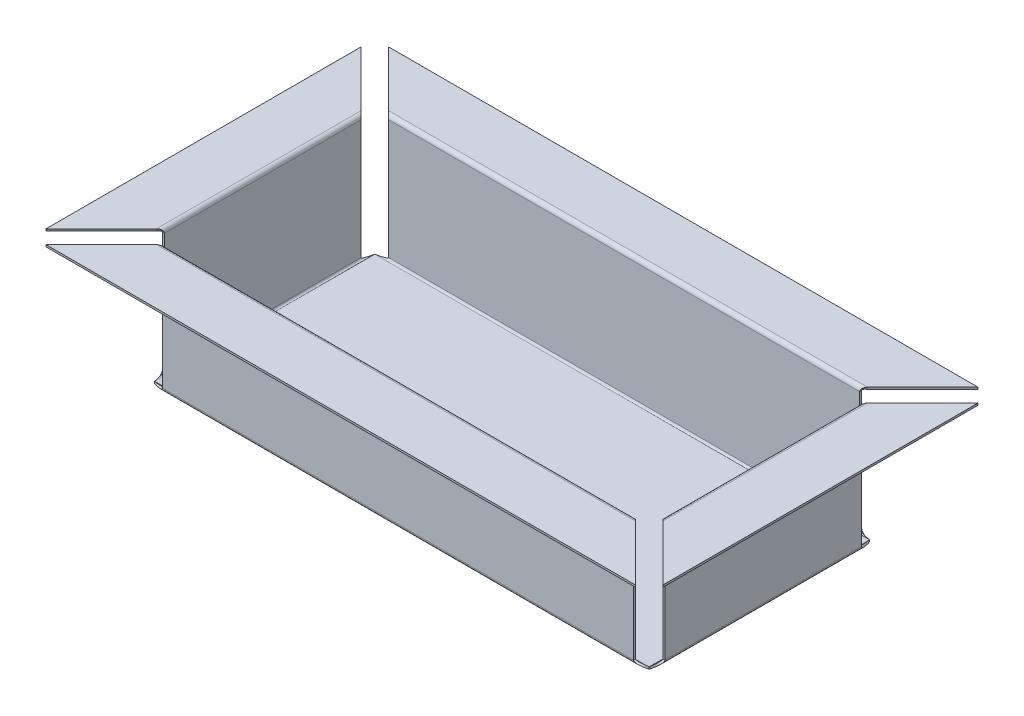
ISO-10303-21;
HEADER;
FILE_DESCRIPTION(('STEP AP214'),'2;1');
FILE_NAME('part.step','',(''),(''),'','','');
FILE_SCHEMA(('AUTOMOTIVE_DESIGN { 1 0 10303 214 1 1 1 1 }'));
ENDSEC;
DATA;
#1=APPLICATION_CONTEXT('core data for automotive mechanical design processes');
#2=APPLICATION_PROTOCOL_DEFINITION('international standard','automotive_design',2000,#1);
#3=PRODUCT_CONTEXT('',#1,'mechanical');
#4=PRODUCT('Part','Part','',(#3));
#5=PRODUCT_RELATED_PRODUCT_CATEGORY('part','',(#4));
#6=PRODUCT_DEFINITION_FORMATION('','',#4);
#7=PRODUCT_DEFINITION_CONTEXT('part definition',#1,'design');
#8=PRODUCT_DEFINITION('design','',#6,#7);
#9=PRODUCT_DEFINITION_SHAPE('','',#8);
#10=(LENGTH_UNIT() NAMED_UNIT(*) SI_UNIT(.MILLI.,.METRE.));
#11=(NAMED_UNIT(*) PLANE_ANGLE_UNIT() SI_UNIT($,.RADIAN.));
#12=(NAMED_UNIT(*) SI_UNIT($,.STERADIAN.) SOLID_ANGLE_UNIT());
#13=UNCERTAINTY_MEASURE_WITH_UNIT(LENGTH_MEASURE(1.E-05),#10,'distance_accuracy_value','');
#14=(GEOMETRIC_REPRESENTATION_CONTEXT(3) GLOBAL_UNCERTAINTY_ASSIGNED_CONTEXT((#13)) GLOBAL_UNIT_ASSIGNED_CONTEXT((#10,
#11,#12)) REPRESENTATION_CONTEXT('',''));
#15=CARTESIAN_POINT('',(0.,0.,0.));
#16=DIRECTION('',(0.,0.,1.));
#17=DIRECTION('',(1.,0.,0.));
#18=AXIS2_PLACEMENT_3D('',#15,#16,#17);
#19=CARTESIAN_POINT('',(-85.8397590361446,0.7366,34.9717536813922));
#20=DIRECTION('',(0.,1.,0.));
#21=DIRECTION('',(0.,0.,1.));
#22=AXIS2_PLACEMENT_3D('',#19,#20,#21);
#23=PLANE('',#22);
#24=DIRECTION('',(0.,0.,1.));
#25=VECTOR('',#24,1.);
#26=CARTESIAN_POINT('',(-85.8397590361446,0.7366,-47.3147255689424));
#27=LINE('',#26,#25);
#28=CARTESIAN_POINT('',(-85.8397590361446,0.7366,-47.3147255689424));
#29=VERTEX_POINT('',#28);
#30=CARTESIAN_POINT('',(-85.8397590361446,0.7366,34.9717536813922));
#31=VERTEX_POINT('',#30);
#32=EDGE_CURVE('E642',#29,#31,#27,.T.);
#33=ORIENTED_EDGE('',*,*,#32,.T.);
#34=DIRECTION('',(1.,0.,0.));
#35=VECTOR('',#34,1.);
#36=CARTESIAN_POINT('',(-85.8397590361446,0.7366,34.9717536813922));
#37=LINE('',#36,#35);
#38=CARTESIAN_POINT('',(98.9307898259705,0.7366,34.9717536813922));
#39=VERTEX_POINT('',#38);
#40=EDGE_CURVE('E644',#31,#39,#37,.T.);
#41=ORIENTED_EDGE('',*,*,#40,.T.);
#42=DIRECTION('',(0.,0.,-1.));
#43=VECTOR('',#42,1.);
#44=CARTESIAN_POINT('',(98.9307898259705,0.7366,-47.3147255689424));
#45=LINE('',#44,#43);
#46=CARTESIAN_POINT('',(98.9307898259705,0.7366,-47.3147255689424));
#47=VERTEX_POINT('',#46);
#48=EDGE_CURVE('E53',#39,#47,#45,.T.);
#49=ORIENTED_EDGE('',*,*,#48,.T.);
#50=DIRECTION('',(-1.,0.,0.));
#51=VECTOR('',#50,1.);
#52=CARTESIAN_POINT('',(-85.8397590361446,0.7366,-47.3147255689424));
#53=LINE('',#52,#51);
#54=EDGE_CURVE('E48',#47,#29,#53,.T.);
#55=ORIENTED_EDGE('',*,*,#54,.T.);
#56=EDGE_LOOP('',(#33,#41,#49,#55));
#57=FACE_BOUND('',#56,.T.);
#58=ADVANCED_FACE('F34',(#57),#23,.T.);
#59=CARTESIAN_POINT('',(-85.8397590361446,0.,34.9717536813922));
#60=DIRECTION('',(0.,1.,0.));
#61=DIRECTION('',(0.,0.,1.));
#62=AXIS2_PLACEMENT_3D('',#59,#60,#61);
#63=PLANE('',#62);
#64=DIRECTION('',(0.,0.,1.));
#65=VECTOR('',#64,1.);
#66=CARTESIAN_POINT('',(-85.8397590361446,0.,-47.3147255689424));
#67=LINE('',#66,#65);
#68=CARTESIAN_POINT('',(-85.8397590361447,0.,-47.3147255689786));
#69=VERTEX_POINT('',#68);
#70=CARTESIAN_POINT('',(-85.8397590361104,0.,34.9717536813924));
#71=VERTEX_POINT('',#70);
#72=EDGE_CURVE('E628',#69,#71,#67,.T.);
#73=ORIENTED_EDGE('',*,*,#72,.F.);
#74=DIRECTION('',(-1.,0.,0.));
#75=VECTOR('',#74,1.);
#76=CARTESIAN_POINT('',(-85.8397590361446,0.,-47.3147255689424));
#77=LINE('',#76,#75);
#78=CARTESIAN_POINT('',(98.930789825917,0.,-47.3147255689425));
#79=VERTEX_POINT('',#78);
#80=EDGE_CURVE('E639',#79,#69,#77,.T.);
#81=ORIENTED_EDGE('',*,*,#80,.F.);
#82=DIRECTION('',(0.,0.,-1.));
#83=VECTOR('',#82,1.);
#84=CARTESIAN_POINT('',(98.9307898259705,0.,-47.3147255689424));
#85=LINE('',#84,#83);
#86=CARTESIAN_POINT('',(98.9307898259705,0.,34.9717536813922));
#87=VERTEX_POINT('',#86);
#88=EDGE_CURVE('E636',#87,#79,#85,.T.);
#89=ORIENTED_EDGE('',*,*,#88,.F.);
#90=DIRECTION('',(1.,0.,0.));
#91=VECTOR('',#90,1.);
#92=CARTESIAN_POINT('',(-85.8397590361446,0.,34.9717536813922));
#93=LINE('',#92,#91);
#94=EDGE_CURVE('E633',#71,#87,#93,.T.);
#95=ORIENTED_EDGE('',*,*,#94,.F.);
#96=EDGE_LOOP('',(#73,#81,#89,#95));
#97=FACE_BOUND('',#96,.T.);
#98=ADVANCED_FACE('F815',(#97),#63,.F.);
#99=CARTESIAN_POINT('',(99.6673898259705,46.0282353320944,30.5818295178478));
#100=DIRECTION('',(0.,0.,1.));
#101=DIRECTION('',(0.,-1.,0.));
#102=AXIS2_PLACEMENT_3D('',#99,#100,#101);
#103=PLANE('',#102);
#104=DIRECTION('',(-1.,0.,0.));
#105=VECTOR('',#104,1.);
#106=CARTESIAN_POINT('',(99.6673898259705,1.4732,30.5818295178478));
#107=LINE('',#106,#105);
#108=CARTESIAN_POINT('',(99.6673898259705,1.4732,30.5818295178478));
#109=VERTEX_POINT('',#108);
#110=CARTESIAN_POINT('',(100.403989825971,1.4732,30.5818295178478));
#111=VERTEX_POINT('',#110);
#112=EDGE_CURVE('E625',#109,#111,#107,.F.);
#113=ORIENTED_EDGE('',*,*,#112,.T.);
#114=DIRECTION('',(0.,1.,0.));
#115=VECTOR('',#114,1.);
#116=CARTESIAN_POINT('',(100.403989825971,46.0282353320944,30.581829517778));
#117=LINE('',#116,#115);
#118=CARTESIAN_POINT('',(100.403989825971,46.0282353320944,30.581829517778));
#119=VERTEX_POINT('',#118);
#120=EDGE_CURVE('E596',#119,#111,#117,.F.);
#121=ORIENTED_EDGE('',*,*,#120,.F.);
#122=DIRECTION('',(-1.,0.,0.));
#123=VECTOR('',#122,1.);
#124=CARTESIAN_POINT('',(99.6673898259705,46.0282353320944,30.581829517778));
#125=LINE('',#124,#123);
#126=CARTESIAN_POINT('',(99.6673898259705,46.0282353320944,30.581829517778));
#127=VERTEX_POINT('',#126);
#128=EDGE_CURVE('E622',#127,#119,#125,.F.);
#129=ORIENTED_EDGE('',*,*,#128,.F.);
#130=DIRECTION('',(0.,-1.,0.));
#131=VECTOR('',#130,1.);
#132=CARTESIAN_POINT('',(99.6673898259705,46.0282353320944,30.5818295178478));
#133=LINE('',#132,#131);
#134=EDGE_CURVE('E564',#127,#109,#133,.T.);
#135=ORIENTED_EDGE('',*,*,#134,.T.);
#136=EDGE_LOOP('',(#113,#121,#129,#135));
#137=FACE_BOUND('',#136,.T.);
#138=ADVANCED_FACE('F819',(#137),#103,.T.);
#139=CARTESIAN_POINT('',(99.6673898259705,46.0282353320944,30.5818295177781));
#140=CARTESIAN_POINT('',(99.9129231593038,46.0282353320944,30.5818295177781));
#141=CARTESIAN_POINT('',(100.158456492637,46.0282353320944,30.5818295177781));
#142=CARTESIAN_POINT('',(100.403989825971,46.0282353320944,30.5818295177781));
#143=CARTESIAN_POINT('',(99.6673898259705,48.9746353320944,30.5818295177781));
#144=CARTESIAN_POINT('',(99.9129231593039,48.4835686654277,30.5818295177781));
#145=CARTESIAN_POINT('',(100.158456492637,47.9925019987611,30.5818295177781));
#146=CARTESIAN_POINT('',(100.403989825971,47.5014353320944,30.5818295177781));
#147=CARTESIAN_POINT('',(102.613789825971,48.9746353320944,33.5282295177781));
#148=CARTESIAN_POINT('',(102.368256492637,48.4835686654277,33.5282295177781));
#149=CARTESIAN_POINT('',(102.122723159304,47.9925019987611,33.5282295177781));
#150=CARTESIAN_POINT('',(101.877189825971,47.5014353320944,33.528229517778));
#151=CARTESIAN_POINT('',(102.613789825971,46.0282353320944,33.5282295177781));
#152=CARTESIAN_POINT('',(102.368256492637,46.0282353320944,33.5282295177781));
#153=CARTESIAN_POINT('',(102.122723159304,46.0282353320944,33.528229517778));
#154=CARTESIAN_POINT('',(101.877189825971,46.0282353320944,33.528229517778));
#155=CARTESIAN_POINT('',(102.613789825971,43.0818353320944,33.5282295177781));
#156=CARTESIAN_POINT('',(102.368256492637,43.5729019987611,33.5282295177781));
#157=CARTESIAN_POINT('',(102.122723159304,44.0639686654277,33.5282295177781));
#158=CARTESIAN_POINT('',(101.877189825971,44.5550353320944,33.528229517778));
#159=CARTESIAN_POINT('',(99.6673898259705,43.0818353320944,30.5818295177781));
#160=CARTESIAN_POINT('',(99.9129231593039,43.5729019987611,30.5818295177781));
#161=CARTESIAN_POINT('',(100.158456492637,44.0639686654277,30.5818295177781));
#162=CARTESIAN_POINT('',(100.403989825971,44.5550353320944,30.5818295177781));
#163=CARTESIAN_POINT('',(99.6673898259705,46.0282353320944,30.5818295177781));
#164=CARTESIAN_POINT('',(99.9129231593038,46.0282353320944,30.5818295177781));
#165=CARTESIAN_POINT('',(100.158456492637,46.0282353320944,30.5818295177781));
#166=CARTESIAN_POINT('',(100.403989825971,46.0282353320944,30.5818295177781));
#167=(BOUNDED_SURFACE() B_SPLINE_SURFACE(3,3,((#139,#140,#141,#142),(#143,#144,#145,#146),(#147,
#148,#149,#150),(#151,#152,#153,#154),(#155,#156,#157,#158),(#159,#160,#161,#162),(#163,#164,
#165,#166)),.UNSPECIFIED.,.T.,.F.,.F.) B_SPLINE_SURFACE_WITH_KNOTS((4,3,4),(4,4),(0.,0.5,1.),
(0.,1.),.UNSPECIFIED.) GEOMETRIC_REPRESENTATION_ITEM() RATIONAL_B_SPLINE_SURFACE(((1.,1.,1.,1.),
(0.333333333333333,0.333333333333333,0.333333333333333,0.333333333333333),(0.333333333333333,
0.333333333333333,0.333333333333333,0.333333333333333),(1.,1.,1.,1.),(0.333333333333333,
0.333333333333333,0.333333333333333,0.333333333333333),(0.333333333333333,0.333333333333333,
0.333333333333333,0.333333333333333),(1.,1.,1.,1.))) REPRESENTATION_ITEM('') SURFACE());
#168=CARTESIAN_POINT('',(101.140589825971,46.0282353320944,32.0550295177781));
#169=DIRECTION('',(-0.894427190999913,0.,0.447213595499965));
#170=DIRECTION('',(-0.447213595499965,0.,-0.894427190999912));
#171=AXIS2_PLACEMENT_3D('',#168,#169,#170);
#172=ELLIPSE('',#171,1.64708767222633,0.7366);
#173=CARTESIAN_POINT('',(101.140589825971,46.7648353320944,32.0550295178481));
#174=VERTEX_POINT('',#173);
#175=EDGE_CURVE('E602',#119,#174,#172,.F.);
#176=DIRECTION('',(0.,1.,0.));
#177=VECTOR('',#176,1.);
#178=CARTESIAN_POINT('',(101.140589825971,47.5014353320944,32.0550295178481));
#179=LINE('',#178,#177);
#180=CARTESIAN_POINT('',(101.140589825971,47.5014353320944,32.0550295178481));
#181=VERTEX_POINT('',#180);
#182=EDGE_CURVE('E619',#181,#174,#179,.F.);
#183=CARTESIAN_POINT('',(101.140589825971,46.0282353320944,32.0550295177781));
#184=DIRECTION('',(-0.707106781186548,0.,0.707106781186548));
#185=DIRECTION('',(-0.707106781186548,0.,-0.707106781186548));
#186=AXIS2_PLACEMENT_3D('',#183,#184,#185);
#187=ELLIPSE('',#186,2.08341942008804,1.4732);
#188=EDGE_CURVE('E561',#127,#181,#187,.F.);
#189=ORIENTED_EDGE('',*,*,#128,.T.);
#190=ORIENTED_EDGE('',*,*,#175,.T.);
#191=ORIENTED_EDGE('',*,*,#182,.F.);
#192=ORIENTED_EDGE('',*,*,#188,.F.);
#193=EDGE_LOOP('',(#189,#190,#191,#192));
#194=FACE_BOUND('',#193,.T.);
#195=ADVANCED_FACE('F823',(#194),#167,.F.);
#196=CARTESIAN_POINT('',(563.78872406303,47.5014353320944,494.703163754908));
#197=DIRECTION('',(-0.707106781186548,0.,0.707106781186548));
#198=DIRECTION('',(0.707106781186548,0.,0.707106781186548));
#199=AXIS2_PLACEMENT_3D('',#196,#197,#198);
#200=PLANE('',#199);
#201=ORIENTED_EDGE('',*,*,#182,.T.);
#202=DIRECTION('',(0.707106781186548,0.,0.707106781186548));
#203=VECTOR('',#202,1.);
#204=CARTESIAN_POINT('',(563.78872406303,46.7648353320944,494.703163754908));
#205=LINE('',#204,#203);
#206=CARTESIAN_POINT('',(121.768851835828,46.7648353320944,52.6832915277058));
#207=VERTEX_POINT('',#206);
#208=EDGE_CURVE('E599',#174,#207,#205,.T.);
#209=ORIENTED_EDGE('',*,*,#208,.T.);
#210=DIRECTION('',(0.,1.,0.));
#211=VECTOR('',#210,1.);
#212=CARTESIAN_POINT('',(121.768851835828,47.5014353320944,52.6832915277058));
#213=LINE('',#212,#211);
#214=CARTESIAN_POINT('',(121.768851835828,47.5014353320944,52.6832915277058));
#215=VERTEX_POINT('',#214);
#216=EDGE_CURVE('E616',#215,#207,#213,.F.);
#217=ORIENTED_EDGE('',*,*,#216,.F.);
#218=DIRECTION('',(0.707106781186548,0.,0.707106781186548));
#219=VECTOR('',#218,1.);
#220=CARTESIAN_POINT('',(563.78872406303,47.5014353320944,494.703163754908));
#221=LINE('',#220,#219);
#222=EDGE_CURVE('E565',#181,#215,#221,.T.);
#223=ORIENTED_EDGE('',*,*,#222,.F.);
#224=EDGE_LOOP('',(#201,#209,#217,#223));
#225=FACE_BOUND('',#224,.T.);
#226=ADVANCED_FACE('F831',(#225),#200,.T.);
#227=CARTESIAN_POINT('',(121.768851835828,47.5014353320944,958.824497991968));
#228=DIRECTION('',(1.,0.,0.));
#229=DIRECTION('',(0.,0.,-1.));
#230=AXIS2_PLACEMENT_3D('',#227,#228,#229);
#231=PLANE('',#230);
#232=ORIENTED_EDGE('',*,*,#216,.T.);
#233=DIRECTION('',(0.,0.,1.));
#234=VECTOR('',#233,1.);
#235=CARTESIAN_POINT('',(121.768851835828,46.7648353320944,958.824497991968));
#236=LINE('',#235,#234);
#237=CARTESIAN_POINT('',(121.768851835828,46.7648353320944,-65.0262634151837));
#238=VERTEX_POINT('',#237);
#239=EDGE_CURVE('E584',#207,#238,#236,.F.);
#240=ORIENTED_EDGE('',*,*,#239,.T.);
#241=DIRECTION('',(0.,1.,0.));
#242=VECTOR('',#241,1.);
#243=CARTESIAN_POINT('',(121.768851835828,47.5014353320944,-65.0262634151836));
#244=LINE('',#243,#242);
#245=CARTESIAN_POINT('',(121.768851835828,47.5014353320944,-65.0262634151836));
#246=VERTEX_POINT('',#245);
#247=EDGE_CURVE('E613',#246,#238,#244,.F.);
#248=ORIENTED_EDGE('',*,*,#247,.F.);
#249=DIRECTION('',(0.,0.,-1.));
#250=VECTOR('',#249,1.);
#251=CARTESIAN_POINT('',(121.768851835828,47.5014353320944,958.824497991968));
#252=LINE('',#251,#250);
#253=EDGE_CURVE('E568',#215,#246,#252,.T.);
#254=ORIENTED_EDGE('',*,*,#253,.F.);
#255=EDGE_LOOP('',(#232,#240,#248,#254));
#256=FACE_BOUND('',#255,.T.);
#257=ADVANCED_FACE('F840',(#256),#231,.T.);
#258=CARTESIAN_POINT('',(-401.207259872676,47.5014353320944,457.949848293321));
#259=DIRECTION('',(-0.707106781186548,0.,-0.707106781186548));
#260=DIRECTION('',(-0.707106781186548,0.,0.707106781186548));
#261=AXIS2_PLACEMENT_3D('',#258,#259,#260);
#262=PLANE('',#261);
#263=ORIENTED_EDGE('',*,*,#247,.T.);
#264=DIRECTION('',(-0.707106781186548,0.,0.707106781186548));
#265=VECTOR('',#264,1.);
#266=CARTESIAN_POINT('',(-401.207259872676,46.7648353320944,457.949848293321));
#267=LINE('',#266,#265);
#268=CARTESIAN_POINT('',(101.140589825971,46.7648353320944,-44.398001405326));
#269=VERTEX_POINT('',#268);
#270=EDGE_CURVE('E593',#238,#269,#267,.T.);
#271=ORIENTED_EDGE('',*,*,#270,.T.);
#272=DIRECTION('',(0.,1.,0.));
#273=VECTOR('',#272,1.);
#274=CARTESIAN_POINT('',(101.140589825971,47.5014353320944,-44.3980014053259));
#275=LINE('',#274,#273);
#276=CARTESIAN_POINT('',(101.140589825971,47.5014353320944,-44.3980014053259));
#277=VERTEX_POINT('',#276);
#278=EDGE_CURVE('E610',#277,#269,#275,.F.);
#279=ORIENTED_EDGE('',*,*,#278,.F.);
#280=DIRECTION('',(-0.707106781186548,0.,0.707106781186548));
#281=VECTOR('',#280,1.);
#282=CARTESIAN_POINT('',(-401.207259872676,47.5014353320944,457.949848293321));
#283=LINE('',#282,#281);
#284=EDGE_CURVE('E557',#246,#277,#283,.T.);
#285=ORIENTED_EDGE('',*,*,#284,.F.);
#286=EDGE_LOOP('',(#263,#271,#279,#285));
#287=FACE_BOUND('',#286,.T.);
#288=ADVANCED_FACE('F844',(#287),#262,.T.);
#289=CARTESIAN_POINT('',(102.613789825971,46.0282353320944,-45.8712014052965));
#290=CARTESIAN_POINT('',(102.368256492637,46.0282353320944,-45.8712014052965));
#291=CARTESIAN_POINT('',(102.122723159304,46.0282353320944,-45.8712014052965));
#292=CARTESIAN_POINT('',(101.877189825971,46.0282353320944,-45.8712014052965));
#293=CARTESIAN_POINT('',(102.613789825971,48.9746353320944,-45.8712014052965));
#294=CARTESIAN_POINT('',(102.368256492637,48.4835686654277,-45.8712014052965));
#295=CARTESIAN_POINT('',(102.122723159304,47.9925019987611,-45.8712014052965));
#296=CARTESIAN_POINT('',(101.877189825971,47.5014353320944,-45.8712014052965));
#297=CARTESIAN_POINT('',(99.6673898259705,48.9746353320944,-42.9248014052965));
#298=CARTESIAN_POINT('',(99.9129231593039,48.4835686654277,-42.9248014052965));
#299=CARTESIAN_POINT('',(100.158456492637,47.9925019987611,-42.9248014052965));
#300=CARTESIAN_POINT('',(100.403989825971,47.5014353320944,-42.9248014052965));
#301=CARTESIAN_POINT('',(99.6673898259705,46.0282353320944,-42.9248014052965));
#302=CARTESIAN_POINT('',(99.9129231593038,46.0282353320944,-42.9248014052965));
#303=CARTESIAN_POINT('',(100.158456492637,46.0282353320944,-42.9248014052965));
#304=CARTESIAN_POINT('',(100.403989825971,46.0282353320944,-42.9248014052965));
#305=CARTESIAN_POINT('',(99.6673898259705,43.0818353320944,-42.9248014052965));
#306=CARTESIAN_POINT('',(99.9129231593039,43.5729019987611,-42.9248014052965));
#307=CARTESIAN_POINT('',(100.158456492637,44.0639686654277,-42.9248014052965));
#308=CARTESIAN_POINT('',(100.403989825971,44.5550353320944,-42.9248014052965));
#309=CARTESIAN_POINT('',(102.613789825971,43.0818353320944,-45.8712014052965));
#310=CARTESIAN_POINT('',(102.368256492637,43.5729019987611,-45.8712014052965));
#311=CARTESIAN_POINT('',(102.122723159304,44.0639686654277,-45.8712014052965));
#312=CARTESIAN_POINT('',(101.877189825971,44.5550353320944,-45.8712014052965));
#313=CARTESIAN_POINT('',(102.613789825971,46.0282353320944,-45.8712014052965));
#314=CARTESIAN_POINT('',(102.368256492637,46.0282353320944,-45.8712014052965));
#315=CARTESIAN_POINT('',(102.122723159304,46.0282353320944,-45.8712014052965));
#316=CARTESIAN_POINT('',(101.877189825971,46.0282353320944,-45.8712014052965));
#317=(BOUNDED_SURFACE() B_SPLINE_SURFACE(3,3,((#289,#290,#291,#292),(#293,#294,#295,#296),(#297,
#298,#299,#300),(#301,#302,#303,#304),(#305,#306,#307,#308),(#309,#310,#311,#312),(#313,#314,
#315,#316)),.UNSPECIFIED.,.T.,.F.,.F.) B_SPLINE_SURFACE_WITH_KNOTS((4,3,4),(4,4),(0.,0.5,1.),
(0.,1.),.UNSPECIFIED.) GEOMETRIC_REPRESENTATION_ITEM() RATIONAL_B_SPLINE_SURFACE(((1.,1.,1.,1.),
(0.333333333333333,0.333333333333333,0.333333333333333,0.333333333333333),(0.333333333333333,
0.333333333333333,0.333333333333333,0.333333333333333),(1.,1.,1.,1.),(0.333333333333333,
0.333333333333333,0.333333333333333,0.333333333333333),(0.333333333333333,0.333333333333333,
0.333333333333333,0.333333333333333),(1.,1.,1.,1.))) REPRESENTATION_ITEM('') SURFACE());
#318=CARTESIAN_POINT('',(101.140589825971,46.0282353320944,-44.3980014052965));
#319=DIRECTION('',(-0.894427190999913,0.,-0.447213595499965));
#320=DIRECTION('',(0.447213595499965,0.,-0.894427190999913));
#321=AXIS2_PLACEMENT_3D('',#318,#319,#320);
#322=ELLIPSE('',#321,1.64708767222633,0.7366);
#323=CARTESIAN_POINT('',(100.403989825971,46.0282353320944,-42.9248014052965));
#324=VERTEX_POINT('',#323);
#325=EDGE_CURVE('E590',#269,#324,#322,.F.);
#326=DIRECTION('',(-1.,0.,0.));
#327=VECTOR('',#326,1.);
#328=CARTESIAN_POINT('',(99.6673898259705,46.0282353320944,-42.9248014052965));
#329=LINE('',#328,#327);
#330=CARTESIAN_POINT('',(99.6673898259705,46.0282353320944,-42.9248014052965));
#331=VERTEX_POINT('',#330);
#332=EDGE_CURVE('E607',#331,#324,#329,.F.);
#333=CARTESIAN_POINT('',(101.140589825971,46.0282353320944,-44.3980014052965));
#334=DIRECTION('',(-0.707106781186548,0.,-0.707106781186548));
#335=DIRECTION('',(0.707106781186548,0.,-0.707106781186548));
#336=AXIS2_PLACEMENT_3D('',#333,#334,#335);
#337=ELLIPSE('',#336,2.08341942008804,1.4732);
#338=EDGE_CURVE('E553',#277,#331,#337,.F.);
#339=ORIENTED_EDGE('',*,*,#278,.T.);
#340=ORIENTED_EDGE('',*,*,#325,.T.);
#341=ORIENTED_EDGE('',*,*,#332,.F.);
#342=ORIENTED_EDGE('',*,*,#338,.F.);
#343=EDGE_LOOP('',(#339,#340,#341,#342));
#344=FACE_BOUND('',#343,.T.);
#345=ADVANCED_FACE('F848',(#344),#317,.F.);
#346=CARTESIAN_POINT('',(99.6673898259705,46.0282353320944,-42.9248014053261));
#347=DIRECTION('',(0.,0.,-1.));
#348=DIRECTION('',(0.,1.,0.));
#349=AXIS2_PLACEMENT_3D('',#346,#347,#348);
#350=PLANE('',#349);
#351=ORIENTED_EDGE('',*,*,#332,.T.);
#352=DIRECTION('',(0.,1.,0.));
#353=VECTOR('',#352,1.);
#354=CARTESIAN_POINT('',(100.403989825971,46.0282353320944,-42.9248014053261));
#355=LINE('',#354,#353);
#356=CARTESIAN_POINT('',(100.403989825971,1.4732,-42.9248014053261));
#357=VERTEX_POINT('',#356);
#358=EDGE_CURVE('E586',#357,#324,#355,.T.);
#359=ORIENTED_EDGE('',*,*,#358,.F.);
#360=DIRECTION('',(-1.,0.,0.));
#361=VECTOR('',#360,1.);
#362=CARTESIAN_POINT('',(99.6673898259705,1.4732,-42.9248014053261));
#363=LINE('',#362,#361);
#364=CARTESIAN_POINT('',(99.6673898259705,1.4732,-42.9248014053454));
#365=VERTEX_POINT('',#364);
#366=EDGE_CURVE('E589',#365,#357,#363,.F.);
#367=ORIENTED_EDGE('',*,*,#366,.F.);
#368=DIRECTION('',(0.,1.,0.));
#369=VECTOR('',#368,1.);
#370=CARTESIAN_POINT('',(99.6673898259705,46.0282353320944,-42.9248014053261));
#371=LINE('',#370,#369);
#372=EDGE_CURVE('E556',#365,#331,#371,.T.);
#373=ORIENTED_EDGE('',*,*,#372,.T.);
#374=EDGE_LOOP('',(#351,#359,#367,#373));
#375=FACE_BOUND('',#374,.T.);
#376=ADVANCED_FACE('F854',(#375),#350,.T.);
#377=CARTESIAN_POINT('',(100.403989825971,46.0282353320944,958.824497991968));
#378=DIRECTION('',(1.,0.,0.));
#379=DIRECTION('',(0.,0.,-1.));
#380=AXIS2_PLACEMENT_3D('',#377,#378,#379);
#381=PLANE('',#380);
#382=ORIENTED_EDGE('',*,*,#358,.T.);
#383=DIRECTION('',(0.,0.,-1.));
#384=VECTOR('',#383,1.);
#385=CARTESIAN_POINT('',(100.403989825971,46.0282353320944,958.824497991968));
#386=LINE('',#385,#384);
#387=EDGE_CURVE('E581',#119,#324,#386,.T.);
#388=ORIENTED_EDGE('',*,*,#387,.F.);
#389=ORIENTED_EDGE('',*,*,#120,.T.);
#390=DIRECTION('',(0.,0.,-1.));
#391=VECTOR('',#390,1.);
#392=CARTESIAN_POINT('',(100.403989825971,1.4732,958.824497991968));
#393=LINE('',#392,#391);
#394=EDGE_CURVE('E583',#111,#357,#393,.T.);
#395=ORIENTED_EDGE('',*,*,#394,.T.);
#396=EDGE_LOOP('',(#382,#388,#389,#395));
#397=FACE_BOUND('',#396,.T.);
#398=ADVANCED_FACE('F863',(#397),#381,.T.);
#399=CARTESIAN_POINT('',(101.140589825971,46.0282353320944,958.824497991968));
#400=DIRECTION('',(0.,0.,-1.));
#401=DIRECTION('',(-1.,0.,0.));
#402=AXIS2_PLACEMENT_3D('',#399,#400,#401);
#403=CYLINDRICAL_SURFACE('',#402,0.7366);
#404=DIRECTION('',(0.,0.,-1.));
#405=VECTOR('',#404,1.);
#406=CARTESIAN_POINT('',(101.140589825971,46.7648353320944,958.824497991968));
#407=LINE('',#406,#405);
#408=EDGE_CURVE('E560',#174,#269,#407,.T.);
#409=ORIENTED_EDGE('',*,*,#408,.F.);
#410=ORIENTED_EDGE('',*,*,#175,.F.);
#411=ORIENTED_EDGE('',*,*,#387,.T.);
#412=ORIENTED_EDGE('',*,*,#325,.F.);
#413=EDGE_LOOP('',(#409,#410,#411,#412));
#414=FACE_BOUND('',#413,.T.);
#415=ADVANCED_FACE('F869',(#414),#403,.F.);
#416=CARTESIAN_POINT('',(99.6673898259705,46.7648353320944,958.824497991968));
#417=DIRECTION('',(0.,1.,0.));
#418=DIRECTION('',(0.,0.,1.));
#419=AXIS2_PLACEMENT_3D('',#416,#417,#418);
#420=PLANE('',#419);
#421=ORIENTED_EDGE('',*,*,#239,.F.);
#422=ORIENTED_EDGE('',*,*,#208,.F.);
#423=ORIENTED_EDGE('',*,*,#408,.T.);
#424=ORIENTED_EDGE('',*,*,#270,.F.);
#425=EDGE_LOOP('',(#421,#422,#423,#424));
#426=FACE_BOUND('',#425,.T.);
#427=ADVANCED_FACE('F865',(#426),#420,.F.);
#428=CARTESIAN_POINT('',(99.6673898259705,46.0282353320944,958.824497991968));
#429=DIRECTION('',(1.,0.,0.));
#430=DIRECTION('',(0.,0.,-1.));
#431=AXIS2_PLACEMENT_3D('',#428,#429,#430);
#432=PLANE('',#431);
#433=ORIENTED_EDGE('',*,*,#372,.F.);
#434=DIRECTION('',(0.,0.,-1.));
#435=VECTOR('',#434,1.);
#436=CARTESIAN_POINT('',(99.6673898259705,1.4732,958.824497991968));
#437=LINE('',#436,#435);
#438=EDGE_CURVE('E574',#109,#365,#437,.T.);
#439=ORIENTED_EDGE('',*,*,#438,.F.);
#440=ORIENTED_EDGE('',*,*,#134,.F.);
#441=DIRECTION('',(0.,0.,-1.));
#442=VECTOR('',#441,1.);
#443=CARTESIAN_POINT('',(99.6673898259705,46.0282353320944,958.824497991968));
#444=LINE('',#443,#442);
#445=EDGE_CURVE('E571',#127,#331,#444,.T.);
#446=ORIENTED_EDGE('',*,*,#445,.T.);
#447=EDGE_LOOP('',(#433,#439,#440,#446));
#448=FACE_BOUND('',#447,.T.);
#449=ADVANCED_FACE('F868',(#448),#432,.F.);
#450=CARTESIAN_POINT('',(101.140589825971,46.0282353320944,958.824497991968));
#451=DIRECTION('',(0.,0.,-1.));
#452=DIRECTION('',(-1.,0.,0.));
#453=AXIS2_PLACEMENT_3D('',#450,#451,#452);
#454=CYLINDRICAL_SURFACE('',#453,1.4732);
#455=DIRECTION('',(0.,0.,-1.));
#456=VECTOR('',#455,1.);
#457=CARTESIAN_POINT('',(101.140589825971,47.5014353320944,958.824497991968));
#458=LINE('',#457,#456);
#459=EDGE_CURVE('E550',#181,#277,#458,.T.);
#460=ORIENTED_EDGE('',*,*,#459,.T.);
#461=ORIENTED_EDGE('',*,*,#338,.T.);
#462=ORIENTED_EDGE('',*,*,#445,.F.);
#463=ORIENTED_EDGE('',*,*,#188,.T.);
#464=EDGE_LOOP('',(#460,#461,#462,#463));
#465=FACE_BOUND('',#464,.T.);
#466=ADVANCED_FACE('F879',(#465),#454,.T.);
#467=CARTESIAN_POINT('',(99.6673898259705,47.5014353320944,958.824497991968));
#468=DIRECTION('',(0.,1.,0.));
#469=DIRECTION('',(0.,0.,1.));
#470=AXIS2_PLACEMENT_3D('',#467,#468,#469);
#471=PLANE('',#470);
#472=ORIENTED_EDGE('',*,*,#253,.T.);
#473=ORIENTED_EDGE('',*,*,#284,.T.);
#474=ORIENTED_EDGE('',*,*,#459,.F.);
#475=ORIENTED_EDGE('',*,*,#222,.T.);
#476=EDGE_LOOP('',(#472,#473,#474,#475));
#477=FACE_BOUND('',#476,.T.);
#478=ADVANCED_FACE('F883',(#477),#471,.T.);
#479=CARTESIAN_POINT('',(100.403989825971,1.4732,30.5818295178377));
#480=CARTESIAN_POINT('',(100.158456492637,1.4732,30.5818295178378));
#481=CARTESIAN_POINT('',(99.9129231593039,1.4732,30.5818295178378));
#482=CARTESIAN_POINT('',(99.6673898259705,1.4732,30.5818295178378));
#483=CARTESIAN_POINT('',(100.403989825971,-1.4732,30.5818295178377));
#484=CARTESIAN_POINT('',(100.158456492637,-0.982133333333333,30.5818295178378));
#485=CARTESIAN_POINT('',(99.9129231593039,-0.491066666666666,30.5818295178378));
#486=CARTESIAN_POINT('',(99.6673898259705,0.,30.5818295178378));
#487=CARTESIAN_POINT('',(97.4575898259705,-1.4732,39.3616778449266));
#488=CARTESIAN_POINT('',(97.7031231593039,-0.982133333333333,39.3616778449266));
#489=CARTESIAN_POINT('',(97.9486564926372,-0.491066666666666,39.3616778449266));
#490=CARTESIAN_POINT('',(98.1941898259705,0.,39.3616778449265));
#491=CARTESIAN_POINT('',(97.4575898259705,1.4732,39.3616778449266));
#492=CARTESIAN_POINT('',(97.7031231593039,1.4732,39.3616778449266));
#493=CARTESIAN_POINT('',(97.9486564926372,1.4732,39.3616778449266));
#494=CARTESIAN_POINT('',(98.1941898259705,1.4732,39.3616778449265));
#495=CARTESIAN_POINT('',(97.4575898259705,4.4196,39.3616778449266));
#496=CARTESIAN_POINT('',(97.7031231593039,3.92853333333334,39.3616778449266));
#497=CARTESIAN_POINT('',(97.9486564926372,3.43746666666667,39.3616778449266));
#498=CARTESIAN_POINT('',(98.1941898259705,2.9464,39.3616778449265));
#499=CARTESIAN_POINT('',(100.403989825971,4.4196,30.5818295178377));
#500=CARTESIAN_POINT('',(100.158456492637,3.92853333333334,30.5818295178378));
#501=CARTESIAN_POINT('',(99.9129231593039,3.43746666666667,30.5818295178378));
#502=CARTESIAN_POINT('',(99.6673898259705,2.9464,30.5818295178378));
#503=CARTESIAN_POINT('',(100.403989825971,1.4732,30.5818295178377));
#504=CARTESIAN_POINT('',(100.158456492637,1.4732,30.5818295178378));
#505=CARTESIAN_POINT('',(99.9129231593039,1.4732,30.5818295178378));
#506=CARTESIAN_POINT('',(99.6673898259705,1.4732,30.5818295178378));
#507=(BOUNDED_SURFACE() B_SPLINE_SURFACE(3,3,((#479,#480,#481,#482),(#483,#484,#485,#486),(#487,
#488,#489,#490),(#491,#492,#493,#494),(#495,#496,#497,#498),(#499,#500,#501,#502),(#503,#504,
#505,#506)),.UNSPECIFIED.,.T.,.F.,.F.) B_SPLINE_SURFACE_WITH_KNOTS((4,3,4),(4,4),(0.,0.5,1.),
(0.,1.),.UNSPECIFIED.) GEOMETRIC_REPRESENTATION_ITEM() RATIONAL_B_SPLINE_SURFACE(((1.,1.,1.,1.),
(0.333333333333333,0.333333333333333,0.333333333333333,0.333333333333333),(0.333333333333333,
0.333333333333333,0.333333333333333,0.333333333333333),(1.,1.,1.,1.),(0.333333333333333,
0.333333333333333,0.333333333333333,0.333333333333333),(0.333333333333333,0.333333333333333,
0.333333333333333,0.333333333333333),(1.,1.,1.,1.))) REPRESENTATION_ITEM('') SURFACE());
#508=DIRECTION('',(0.,-1.,0.));
#509=VECTOR('',#508,1.);
#510=CARTESIAN_POINT('',(98.9307898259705,0.7366,34.9717536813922));
#511=LINE('',#510,#509);
#512=EDGE_CURVE('E41',#39,#87,#511,.T.);
#513=CARTESIAN_POINT('',(98.9307898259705,1.4732,34.9717536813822));
#514=DIRECTION('',(0.948040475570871,0.,0.318149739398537));
#515=DIRECTION('',(0.318149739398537,0.,-0.948040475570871));
#516=AXIS2_PLACEMENT_3D('',#513,#514,#515);
#517=ELLIPSE('',#516,4.63052398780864,1.4732);
#518=EDGE_CURVE('E546',#111,#87,#517,.F.);
#519=CARTESIAN_POINT('',(98.9307898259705,1.4732,34.9717536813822));
#520=DIRECTION('',(0.986213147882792,0.,0.165479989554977));
#521=DIRECTION('',(0.165479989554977,0.,-0.986213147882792));
#522=AXIS2_PLACEMENT_3D('',#519,#520,#521);
#523=ELLIPSE('',#522,4.45129348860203,0.7366);
#524=EDGE_CURVE('E515',#109,#39,#523,.F.);
#525=ORIENTED_EDGE('',*,*,#512,.T.);
#526=ORIENTED_EDGE('',*,*,#518,.F.);
#527=ORIENTED_EDGE('',*,*,#112,.F.);
#528=ORIENTED_EDGE('',*,*,#524,.T.);
#529=EDGE_LOOP('',(#525,#526,#527,#528));
#530=FACE_BOUND('',#529,.T.);
#531=ADVANCED_FACE('F655',(#530),#507,.F.);
#532=CARTESIAN_POINT('',(97.4575898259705,1.4732,-51.7046497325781));
#533=CARTESIAN_POINT('',(97.7031231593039,1.4732,-51.704649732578));
#534=CARTESIAN_POINT('',(97.9486564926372,1.4732,-51.704649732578));
#535=CARTESIAN_POINT('',(98.1941898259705,1.4732,-51.704649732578));
#536=CARTESIAN_POINT('',(97.4575898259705,-1.4732,-51.7046497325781));
#537=CARTESIAN_POINT('',(97.7031231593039,-0.982133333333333,-51.7046497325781));
#538=CARTESIAN_POINT('',(97.9486564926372,-0.491066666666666,-51.704649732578));
#539=CARTESIAN_POINT('',(98.1941898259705,0.,-51.704649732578));
#540=CARTESIAN_POINT('',(100.403989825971,-1.4732,-42.9248014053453));
#541=CARTESIAN_POINT('',(100.158456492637,-0.982133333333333,-42.9248014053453));
#542=CARTESIAN_POINT('',(99.9129231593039,-0.491066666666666,-42.9248014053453));
#543=CARTESIAN_POINT('',(99.6673898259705,0.,-42.9248014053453));
#544=CARTESIAN_POINT('',(100.403989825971,1.4732,-42.9248014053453));
#545=CARTESIAN_POINT('',(100.158456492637,1.4732,-42.9248014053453));
#546=CARTESIAN_POINT('',(99.9129231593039,1.4732,-42.9248014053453));
#547=CARTESIAN_POINT('',(99.6673898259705,1.4732,-42.9248014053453));
#548=CARTESIAN_POINT('',(100.403989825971,4.4196,-42.9248014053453));
#549=CARTESIAN_POINT('',(100.158456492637,3.92853333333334,-42.9248014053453));
#550=CARTESIAN_POINT('',(99.9129231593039,3.43746666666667,-42.9248014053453));
#551=CARTESIAN_POINT('',(99.6673898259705,2.9464,-42.9248014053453));
#552=CARTESIAN_POINT('',(97.4575898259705,4.4196,-51.7046497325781));
#553=CARTESIAN_POINT('',(97.7031231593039,3.92853333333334,-51.7046497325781));
#554=CARTESIAN_POINT('',(97.9486564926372,3.43746666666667,-51.704649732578));
#555=CARTESIAN_POINT('',(98.1941898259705,2.9464,-51.704649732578));
#556=CARTESIAN_POINT('',(97.4575898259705,1.4732,-51.7046497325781));
#557=CARTESIAN_POINT('',(97.7031231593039,1.4732,-51.704649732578));
#558=CARTESIAN_POINT('',(97.9486564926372,1.4732,-51.704649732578));
#559=CARTESIAN_POINT('',(98.1941898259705,1.4732,-51.704649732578));
#560=(BOUNDED_SURFACE() B_SPLINE_SURFACE(3,3,((#532,#533,#534,#535),(#536,#537,#538,#539),(#540,
#541,#542,#543),(#544,#545,#546,#547),(#548,#549,#550,#551),(#552,#553,#554,#555),(#556,#557,
#558,#559)),.UNSPECIFIED.,.T.,.F.,.F.) B_SPLINE_SURFACE_WITH_KNOTS((4,3,4),(4,4),(0.,0.5,1.),
(0.,1.),.UNSPECIFIED.) GEOMETRIC_REPRESENTATION_ITEM() RATIONAL_B_SPLINE_SURFACE(((1.,1.,1.,1.),
(0.333333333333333,0.333333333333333,0.333333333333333,0.333333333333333),(0.333333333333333,
0.333333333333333,0.333333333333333,0.333333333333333),(1.,1.,1.,1.),(0.333333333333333,
0.333333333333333,0.333333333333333,0.333333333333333),(0.333333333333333,0.333333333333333,
0.333333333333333,0.333333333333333),(1.,1.,1.,1.))) REPRESENTATION_ITEM('') SURFACE());
#561=CARTESIAN_POINT('',(98.9307898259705,1.4732,-47.3147255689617));
#562=DIRECTION('',(0.948040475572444,0.,-0.318149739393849));
#563=DIRECTION('',(-0.318149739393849,0.,-0.948040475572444));
#564=AXIS2_PLACEMENT_3D('',#561,#562,#563);
#565=ELLIPSE('',#564,4.63052398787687,1.4732);
#566=EDGE_CURVE('E547',#79,#357,#565,.F.);
#567=DIRECTION('',(0.,-1.,0.));
#568=VECTOR('',#567,1.);
#569=CARTESIAN_POINT('',(98.9307898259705,0.7366,-47.3147255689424));
#570=LINE('',#569,#568);
#571=EDGE_CURVE('E651',#47,#79,#570,.T.);
#572=CARTESIAN_POINT('',(98.9307898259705,1.4732,-47.3147255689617));
#573=DIRECTION('',(0.986213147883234,0.,-0.165479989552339));
#574=DIRECTION('',(-0.165479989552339,0.,-0.986213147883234));
#575=AXIS2_PLACEMENT_3D('',#572,#573,#574);
#576=ELLIPSE('',#575,4.451293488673,0.7366);
#577=EDGE_CURVE('E543',#47,#365,#576,.F.);
#578=ORIENTED_EDGE('',*,*,#366,.T.);
#579=ORIENTED_EDGE('',*,*,#566,.F.);
#580=ORIENTED_EDGE('',*,*,#571,.F.);
#581=ORIENTED_EDGE('',*,*,#577,.T.);
#582=EDGE_LOOP('',(#578,#579,#580,#581));
#583=FACE_BOUND('',#582,.T.);
#584=ADVANCED_FACE('F712',(#583),#560,.F.);
#585=CARTESIAN_POINT('',(98.9307898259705,1.4732,958.824497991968));
#586=DIRECTION('',(0.,0.,-1.));
#587=DIRECTION('',(-1.,0.,0.));
#588=AXIS2_PLACEMENT_3D('',#585,#586,#587);
#589=CYLINDRICAL_SURFACE('',#588,1.4732);
#590=ORIENTED_EDGE('',*,*,#566,.T.);
#591=ORIENTED_EDGE('',*,*,#394,.F.);
#592=ORIENTED_EDGE('',*,*,#518,.T.);
#593=ORIENTED_EDGE('',*,*,#88,.T.);
#594=EDGE_LOOP('',(#590,#591,#592,#593));
#595=FACE_BOUND('',#594,.T.);
#596=ADVANCED_FACE('F901',(#595),#589,.T.);
#597=CARTESIAN_POINT('',(98.9307898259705,1.4732,958.824497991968));
#598=DIRECTION('',(0.,0.,-1.));
#599=DIRECTION('',(-1.,0.,0.));
#600=AXIS2_PLACEMENT_3D('',#597,#598,#599);
#601=CYLINDRICAL_SURFACE('',#600,0.7366);
#602=ORIENTED_EDGE('',*,*,#577,.F.);
#603=ORIENTED_EDGE('',*,*,#48,.F.);
#604=ORIENTED_EDGE('',*,*,#524,.F.);
#605=ORIENTED_EDGE('',*,*,#438,.T.);
#606=EDGE_LOOP('',(#602,#603,#604,#605));
#607=FACE_BOUND('',#606,.T.);
#608=ADVANCED_FACE('F709',(#607),#601,.F.);
#609=CARTESIAN_POINT('',(94.5408656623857,46.0282353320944,-48.0513255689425));
#610=DIRECTION('',(1.,0.,0.));
#611=DIRECTION('',(0.,-1.,0.));
#612=AXIS2_PLACEMENT_3D('',#609,#610,#611);
#613=PLANE('',#612);
#614=DIRECTION('',(0.,0.,1.));
#615=VECTOR('',#614,1.);
#616=CARTESIAN_POINT('',(94.5408656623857,1.4732,-48.0513255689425));
#617=LINE('',#616,#615);
#618=CARTESIAN_POINT('',(94.5408656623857,1.4732,-48.0513255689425));
#619=VERTEX_POINT('',#618);
#620=CARTESIAN_POINT('',(94.5408656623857,1.4732,-48.7879255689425));
#621=VERTEX_POINT('',#620);
#622=EDGE_CURVE('E425',#619,#621,#617,.F.);
#623=ORIENTED_EDGE('',*,*,#622,.T.);
#624=DIRECTION('',(0.,1.,0.));
#625=VECTOR('',#624,1.);
#626=CARTESIAN_POINT('',(94.5408656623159,46.0282353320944,-48.7879255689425));
#627=LINE('',#626,#625);
#628=CARTESIAN_POINT('',(94.5408656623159,46.0282353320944,-48.7879255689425));
#629=VERTEX_POINT('',#628);
#630=EDGE_CURVE('E486',#629,#621,#627,.F.);
#631=ORIENTED_EDGE('',*,*,#630,.F.);
#632=DIRECTION('',(0.,0.,1.));
#633=VECTOR('',#632,1.);
#634=CARTESIAN_POINT('',(94.5408656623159,46.0282353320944,-48.0513255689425));
#635=LINE('',#634,#633);
#636=CARTESIAN_POINT('',(94.5408656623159,46.0282353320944,-48.0513255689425));
#637=VERTEX_POINT('',#636);
#638=EDGE_CURVE('E459',#637,#629,#635,.F.);
#639=ORIENTED_EDGE('',*,*,#638,.F.);
#640=DIRECTION('',(0.,-1.,0.));
#641=VECTOR('',#640,1.);
#642=CARTESIAN_POINT('',(94.5408656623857,46.0282353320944,-48.0513255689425));
#643=LINE('',#642,#641);
#644=EDGE_CURVE('E458',#637,#619,#643,.T.);
#645=ORIENTED_EDGE('',*,*,#644,.T.);
#646=EDGE_LOOP('',(#623,#631,#639,#645));
#647=FACE_BOUND('',#646,.T.);
#648=ADVANCED_FACE('F724',(#647),#613,.T.);
#649=CARTESIAN_POINT('',(94.540865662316,46.0282353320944,-48.0513255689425));
#650=CARTESIAN_POINT('',(94.540865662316,46.0282353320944,-48.2968589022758));
#651=CARTESIAN_POINT('',(94.540865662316,46.0282353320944,-48.5423922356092));
#652=CARTESIAN_POINT('',(94.540865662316,46.0282353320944,-48.7879255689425));
#653=CARTESIAN_POINT('',(94.540865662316,48.9746353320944,-48.0513255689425));
#654=CARTESIAN_POINT('',(94.540865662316,48.4835686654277,-48.2968589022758));
#655=CARTESIAN_POINT('',(94.540865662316,47.9925019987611,-48.5423922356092));
#656=CARTESIAN_POINT('',(94.540865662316,47.5014353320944,-48.7879255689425));
#657=CARTESIAN_POINT('',(97.487265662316,48.9746353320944,-50.9977255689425));
#658=CARTESIAN_POINT('',(97.487265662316,48.4835686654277,-50.7521922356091));
#659=CARTESIAN_POINT('',(97.4872656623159,47.9925019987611,-50.5066589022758));
#660=CARTESIAN_POINT('',(97.4872656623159,47.5014353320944,-50.2611255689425));
#661=CARTESIAN_POINT('',(97.4872656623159,46.0282353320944,-50.9977255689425));
#662=CARTESIAN_POINT('',(97.4872656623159,46.0282353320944,-50.7521922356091));
#663=CARTESIAN_POINT('',(97.4872656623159,46.0282353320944,-50.5066589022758));
#664=CARTESIAN_POINT('',(97.4872656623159,46.0282353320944,-50.2611255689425));
#665=CARTESIAN_POINT('',(97.487265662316,43.0818353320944,-50.9977255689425));
#666=CARTESIAN_POINT('',(97.487265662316,43.572901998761,-50.7521922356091));
#667=CARTESIAN_POINT('',(97.4872656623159,44.0639686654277,-50.5066589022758));
#668=CARTESIAN_POINT('',(97.4872656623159,44.5550353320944,-50.2611255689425));
#669=CARTESIAN_POINT('',(94.540865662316,43.0818353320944,-48.0513255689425));
#670=CARTESIAN_POINT('',(94.540865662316,43.572901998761,-48.2968589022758));
#671=CARTESIAN_POINT('',(94.540865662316,44.0639686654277,-48.5423922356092));
#672=CARTESIAN_POINT('',(94.540865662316,44.5550353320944,-48.7879255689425));
#673=CARTESIAN_POINT('',(94.540865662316,46.0282353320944,-48.0513255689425));
#674=CARTESIAN_POINT('',(94.540865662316,46.0282353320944,-48.2968589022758));
#675=CARTESIAN_POINT('',(94.540865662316,46.0282353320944,-48.5423922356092));
#676=CARTESIAN_POINT('',(94.540865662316,46.0282353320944,-48.7879255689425));
#677=(BOUNDED_SURFACE() B_SPLINE_SURFACE(3,3,((#649,#650,#651,#652),(#653,#654,#655,#656),(#657,
#658,#659,#660),(#661,#662,#663,#664),(#665,#666,#667,#668),(#669,#670,#671,#672),(#673,#674,
#675,#676)),.UNSPECIFIED.,.T.,.F.,.F.) B_SPLINE_SURFACE_WITH_KNOTS((4,3,4),(4,4),(0.,0.5,1.),
(0.,1.),.UNSPECIFIED.) GEOMETRIC_REPRESENTATION_ITEM() RATIONAL_B_SPLINE_SURFACE(((1.,1.,1.,1.),
(0.333333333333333,0.333333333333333,0.333333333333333,0.333333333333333),(0.333333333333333,
0.333333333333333,0.333333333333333,0.333333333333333),(1.,1.,1.,1.),(0.333333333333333,
0.333333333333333,0.333333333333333,0.333333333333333),(0.333333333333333,0.333333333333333,
0.333333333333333,0.333333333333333),(1.,1.,1.,1.))) REPRESENTATION_ITEM('') SURFACE());
#678=CARTESIAN_POINT('',(96.014065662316,46.0282353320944,-49.5245255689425));
#679=DIRECTION('',(0.447213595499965,0.,0.894427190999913));
#680=DIRECTION('',(-0.894427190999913,0.,0.447213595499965));
#681=AXIS2_PLACEMENT_3D('',#678,#679,#680);
#682=ELLIPSE('',#681,1.64708767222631,0.7366);
#683=CARTESIAN_POINT('',(96.0140656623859,46.7648353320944,-49.5245255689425));
#684=VERTEX_POINT('',#683);
#685=EDGE_CURVE('E462',#629,#684,#682,.F.);
#686=DIRECTION('',(0.,1.,0.));
#687=VECTOR('',#686,1.);
#688=CARTESIAN_POINT('',(96.0140656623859,47.5014353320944,-49.5245255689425));
#689=LINE('',#688,#687);
#690=CARTESIAN_POINT('',(96.0140656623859,47.5014353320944,-49.5245255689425));
#691=VERTEX_POINT('',#690);
#692=EDGE_CURVE('E463',#691,#684,#689,.F.);
#693=CARTESIAN_POINT('',(96.014065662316,46.0282353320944,-49.5245255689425));
#694=DIRECTION('',(0.707106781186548,0.,0.707106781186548));
#695=DIRECTION('',(-0.707106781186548,0.,0.707106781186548));
#696=AXIS2_PLACEMENT_3D('',#693,#694,#695);
#697=ELLIPSE('',#696,2.08341942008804,1.4732);
#698=EDGE_CURVE('E523',#637,#691,#697,.F.);
#699=ORIENTED_EDGE('',*,*,#638,.T.);
#700=ORIENTED_EDGE('',*,*,#685,.T.);
#701=ORIENTED_EDGE('',*,*,#692,.F.);
#702=ORIENTED_EDGE('',*,*,#698,.F.);
#703=EDGE_LOOP('',(#699,#700,#701,#702));
#704=FACE_BOUND('',#703,.T.);
#705=ADVANCED_FACE('F748',(#704),#677,.F.);
#706=CARTESIAN_POINT('',(558.662199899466,47.5014353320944,-512.172659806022));
#707=DIRECTION('',(0.707106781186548,0.,0.707106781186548));
#708=DIRECTION('',(0.707106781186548,0.,-0.707106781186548));
#709=AXIS2_PLACEMENT_3D('',#706,#707,#708);
#710=PLANE('',#709);
#711=ORIENTED_EDGE('',*,*,#692,.T.);
#712=DIRECTION('',(0.707106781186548,0.,-0.707106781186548));
#713=VECTOR('',#712,1.);
#714=CARTESIAN_POINT('',(558.662199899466,46.7648353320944,-512.172659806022));
#715=LINE('',#714,#713);
#716=CARTESIAN_POINT('',(116.642327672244,46.7648353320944,-70.1527875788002));
#717=VERTEX_POINT('',#716);
#718=EDGE_CURVE('E466',#684,#717,#715,.T.);
#719=ORIENTED_EDGE('',*,*,#718,.T.);
#720=DIRECTION('',(0.,1.,0.));
#721=VECTOR('',#720,1.);
#722=CARTESIAN_POINT('',(116.642327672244,47.5014353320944,-70.1527875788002));
#723=LINE('',#722,#721);
#724=CARTESIAN_POINT('',(116.642327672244,47.5014353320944,-70.1527875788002));
#725=VERTEX_POINT('',#724);
#726=EDGE_CURVE('E467',#725,#717,#723,.F.);
#727=ORIENTED_EDGE('',*,*,#726,.F.);
#728=DIRECTION('',(0.707106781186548,0.,-0.707106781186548));
#729=VECTOR('',#728,1.);
#730=CARTESIAN_POINT('',(558.662199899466,47.5014353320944,-512.172659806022));
#731=LINE('',#730,#729);
#732=EDGE_CURVE('E508',#691,#725,#731,.T.);
#733=ORIENTED_EDGE('',*,*,#732,.F.);
#734=EDGE_LOOP('',(#711,#719,#727,#733));
#735=FACE_BOUND('',#734,.T.);
#736=ADVANCED_FACE('F969',(#735),#710,.T.);
#737=CARTESIAN_POINT('',(1022.78353413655,47.5014353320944,-70.1527875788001));
#738=DIRECTION('',(0.,0.,-1.));
#739=DIRECTION('',(-1.,0.,0.));
#740=AXIS2_PLACEMENT_3D('',#737,#738,#739);
#741=PLANE('',#740);
#742=ORIENTED_EDGE('',*,*,#726,.T.);
#743=DIRECTION('',(1.,0.,0.));
#744=VECTOR('',#743,1.);
#745=CARTESIAN_POINT('',(1022.78353413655,46.7648353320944,-70.1527875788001));
#746=LINE('',#745,#744);
#747=CARTESIAN_POINT('',(-103.551296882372,46.7648353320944,-70.1527875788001));
#748=VERTEX_POINT('',#747);
#749=EDGE_CURVE('E470',#717,#748,#746,.F.);
#750=ORIENTED_EDGE('',*,*,#749,.T.);
#751=DIRECTION('',(0.,1.,0.));
#752=VECTOR('',#751,1.);
#753=CARTESIAN_POINT('',(-103.551296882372,47.5014353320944,-70.1527875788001));
#754=LINE('',#753,#752);
#755=CARTESIAN_POINT('',(-103.551296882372,47.5014353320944,-70.1527875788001));
#756=VERTEX_POINT('',#755);
#757=EDGE_CURVE('E471',#756,#748,#754,.F.);
#758=ORIENTED_EDGE('',*,*,#757,.F.);
#759=DIRECTION('',(-1.,0.,0.));
#760=VECTOR('',#759,1.);
#761=CARTESIAN_POINT('',(1022.78353413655,47.5014353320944,-70.1527875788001));
#762=LINE('',#761,#760);
#763=EDGE_CURVE('E509',#725,#756,#762,.T.);
#764=ORIENTED_EDGE('',*,*,#763,.F.);
#765=EDGE_LOOP('',(#742,#750,#758,#764));
#766=FACE_BOUND('',#765,.T.);
#767=ADVANCED_FACE('F965',(#766),#741,.T.);
#768=CARTESIAN_POINT('',(470.666849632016,47.5014353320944,504.065358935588));
#769=DIRECTION('',(-0.707106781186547,0.,0.707106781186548));
#770=DIRECTION('',(0.707106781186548,0.,0.707106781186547));
#771=AXIS2_PLACEMENT_3D('',#768,#769,#770);
#772=PLANE('',#771);
#773=ORIENTED_EDGE('',*,*,#757,.T.);
#774=DIRECTION('',(0.707106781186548,0.,0.707106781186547));
#775=VECTOR('',#774,1.);
#776=CARTESIAN_POINT('',(470.666849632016,46.7648353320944,504.065358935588));
#777=LINE('',#776,#775);
#778=CARTESIAN_POINT('',(-82.9230348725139,46.7648353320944,-49.5245255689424));
#779=VERTEX_POINT('',#778);
#780=EDGE_CURVE('E474',#748,#779,#777,.T.);
#781=ORIENTED_EDGE('',*,*,#780,.T.);
#782=DIRECTION('',(0.,1.,0.));
#783=VECTOR('',#782,1.);
#784=CARTESIAN_POINT('',(-82.9230348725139,47.5014353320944,-49.5245255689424));
#785=LINE('',#784,#783);
#786=CARTESIAN_POINT('',(-82.9230348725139,47.5014353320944,-49.5245255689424));
#787=VERTEX_POINT('',#786);
#788=EDGE_CURVE('E475',#787,#779,#785,.F.);
#789=ORIENTED_EDGE('',*,*,#788,.F.);
#790=DIRECTION('',(0.707106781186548,0.,0.707106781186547));
#791=VECTOR('',#790,1.);
#792=CARTESIAN_POINT('',(470.666849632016,47.5014353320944,504.065358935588));
#793=LINE('',#792,#791);
#794=EDGE_CURVE('E505',#756,#787,#793,.T.);
#795=ORIENTED_EDGE('',*,*,#794,.F.);
#796=EDGE_LOOP('',(#773,#781,#789,#795));
#797=FACE_BOUND('',#796,.T.);
#798=ADVANCED_FACE('F957',(#797),#772,.T.);
#799=CARTESIAN_POINT('',(-84.3962348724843,46.0282353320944,-50.9977255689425));
#800=CARTESIAN_POINT('',(-84.3962348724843,46.0282353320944,-50.7521922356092));
#801=CARTESIAN_POINT('',(-84.3962348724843,46.0282353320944,-50.5066589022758));
#802=CARTESIAN_POINT('',(-84.3962348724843,46.0282353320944,-50.2611255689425));
#803=CARTESIAN_POINT('',(-84.3962348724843,48.9746353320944,-50.9977255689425));
#804=CARTESIAN_POINT('',(-84.3962348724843,48.4835686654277,-50.7521922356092));
#805=CARTESIAN_POINT('',(-84.3962348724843,47.9925019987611,-50.5066589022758));
#806=CARTESIAN_POINT('',(-84.3962348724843,47.5014353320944,-50.2611255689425));
#807=CARTESIAN_POINT('',(-81.4498348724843,48.9746353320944,-48.0513255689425));
#808=CARTESIAN_POINT('',(-81.4498348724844,48.4835686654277,-48.2968589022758));
#809=CARTESIAN_POINT('',(-81.4498348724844,47.9925019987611,-48.5423922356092));
#810=CARTESIAN_POINT('',(-81.4498348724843,47.5014353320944,-48.7879255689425));
#811=CARTESIAN_POINT('',(-81.4498348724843,46.0282353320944,-48.0513255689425));
#812=CARTESIAN_POINT('',(-81.4498348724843,46.0282353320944,-48.2968589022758));
#813=CARTESIAN_POINT('',(-81.4498348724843,46.0282353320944,-48.5423922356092));
#814=CARTESIAN_POINT('',(-81.4498348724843,46.0282353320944,-48.7879255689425));
#815=CARTESIAN_POINT('',(-81.4498348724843,43.0818353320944,-48.0513255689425));
#816=CARTESIAN_POINT('',(-81.4498348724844,43.5729019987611,-48.2968589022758));
#817=CARTESIAN_POINT('',(-81.4498348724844,44.0639686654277,-48.5423922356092));
#818=CARTESIAN_POINT('',(-81.4498348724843,44.5550353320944,-48.7879255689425));
#819=CARTESIAN_POINT('',(-84.3962348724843,43.0818353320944,-50.9977255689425));
#820=CARTESIAN_POINT('',(-84.3962348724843,43.5729019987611,-50.7521922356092));
#821=CARTESIAN_POINT('',(-84.3962348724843,44.0639686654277,-50.5066589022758));
#822=CARTESIAN_POINT('',(-84.3962348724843,44.5550353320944,-50.2611255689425));
#823=CARTESIAN_POINT('',(-84.3962348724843,46.0282353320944,-50.9977255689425));
#824=CARTESIAN_POINT('',(-84.3962348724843,46.0282353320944,-50.7521922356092));
#825=CARTESIAN_POINT('',(-84.3962348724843,46.0282353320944,-50.5066589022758));
#826=CARTESIAN_POINT('',(-84.3962348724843,46.0282353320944,-50.2611255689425));
#827=(BOUNDED_SURFACE() B_SPLINE_SURFACE(3,3,((#799,#800,#801,#802),(#803,#804,#805,#806),(#807,
#808,#809,#810),(#811,#812,#813,#814),(#815,#816,#817,#818),(#819,#820,#821,#822),(#823,#824,
#825,#826)),.UNSPECIFIED.,.T.,.F.,.F.) B_SPLINE_SURFACE_WITH_KNOTS((4,3,4),(4,4),(0.,0.5,1.),
(0.,1.),.UNSPECIFIED.) GEOMETRIC_REPRESENTATION_ITEM() RATIONAL_B_SPLINE_SURFACE(((1.,1.,1.,1.),
(0.333333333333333,0.333333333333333,0.333333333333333,0.333333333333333),(0.333333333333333,
0.333333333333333,0.333333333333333,0.333333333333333),(1.,1.,1.,1.),(0.333333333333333,
0.333333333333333,0.333333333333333,0.333333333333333),(0.333333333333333,0.333333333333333,
0.333333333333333,0.333333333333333),(1.,1.,1.,1.))) REPRESENTATION_ITEM('') SURFACE());
#828=CARTESIAN_POINT('',(-82.9230348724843,46.0282353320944,-49.5245255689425));
#829=DIRECTION('',(-0.447213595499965,0.,0.894427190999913));
#830=DIRECTION('',(-0.894427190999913,0.,-0.447213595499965));
#831=AXIS2_PLACEMENT_3D('',#828,#829,#830);
#832=ELLIPSE('',#831,1.64708767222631,0.7366);
#833=CARTESIAN_POINT('',(-81.4498348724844,46.0282353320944,-48.7879255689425));
#834=VERTEX_POINT('',#833);
#835=EDGE_CURVE('E478',#779,#834,#832,.F.);
#836=DIRECTION('',(0.,0.,1.));
#837=VECTOR('',#836,1.);
#838=CARTESIAN_POINT('',(-81.4498348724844,46.0282353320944,-48.0513255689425));
#839=LINE('',#838,#837);
#840=CARTESIAN_POINT('',(-81.4498348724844,46.0282353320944,-48.0513255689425));
#841=VERTEX_POINT('',#840);
#842=EDGE_CURVE('E479',#841,#834,#839,.F.);
#843=CARTESIAN_POINT('',(-82.9230348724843,46.0282353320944,-49.5245255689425));
#844=DIRECTION('',(-0.707106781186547,0.,0.707106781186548));
#845=DIRECTION('',(-0.707106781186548,0.,-0.707106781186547));
#846=AXIS2_PLACEMENT_3D('',#843,#844,#845);
#847=ELLIPSE('',#846,2.08341942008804,1.4732);
#848=EDGE_CURVE('E520',#787,#841,#847,.F.);
#849=ORIENTED_EDGE('',*,*,#788,.T.);
#850=ORIENTED_EDGE('',*,*,#835,.T.);
#851=ORIENTED_EDGE('',*,*,#842,.F.);
#852=ORIENTED_EDGE('',*,*,#848,.F.);
#853=EDGE_LOOP('',(#849,#850,#851,#852));
#854=FACE_BOUND('',#853,.T.);
#855=ADVANCED_FACE('F739',(#854),#827,.F.);
#856=CARTESIAN_POINT('',(-81.4498348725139,46.0282353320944,-48.0513255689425));
#857=DIRECTION('',(-1.,0.,0.));
#858=DIRECTION('',(0.,1.,0.));
#859=AXIS2_PLACEMENT_3D('',#856,#857,#858);
#860=PLANE('',#859);
#861=ORIENTED_EDGE('',*,*,#842,.T.);
#862=DIRECTION('',(0.,1.,0.));
#863=VECTOR('',#862,1.);
#864=CARTESIAN_POINT('',(-81.4498348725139,46.0282353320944,-48.7879255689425));
#865=LINE('',#864,#863);
#866=CARTESIAN_POINT('',(-81.4498348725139,1.4732,-48.7879255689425));
#867=VERTEX_POINT('',#866);
#868=EDGE_CURVE('E488',#867,#834,#865,.T.);
#869=ORIENTED_EDGE('',*,*,#868,.F.);
#870=DIRECTION('',(0.,0.,1.));
#871=VECTOR('',#870,1.);
#872=CARTESIAN_POINT('',(-81.4498348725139,1.4732,-48.0513255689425));
#873=LINE('',#872,#871);
#874=CARTESIAN_POINT('',(-81.4498348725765,1.4732,-48.0513255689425));
#875=VERTEX_POINT('',#874);
#876=EDGE_CURVE('E451',#875,#867,#873,.F.);
#877=ORIENTED_EDGE('',*,*,#876,.F.);
#878=DIRECTION('',(0.,1.,0.));
#879=VECTOR('',#878,1.);
#880=CARTESIAN_POINT('',(-81.4498348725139,46.0282353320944,-48.0513255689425));
#881=LINE('',#880,#879);
#882=EDGE_CURVE('E482',#875,#841,#881,.T.);
#883=ORIENTED_EDGE('',*,*,#882,.T.);
#884=EDGE_LOOP('',(#861,#869,#877,#883));
#885=FACE_BOUND('',#884,.T.);
#886=ADVANCED_FACE('F733',(#885),#860,.T.);
#887=CARTESIAN_POINT('',(1022.78353413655,46.0282353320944,-48.7879255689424));
#888=DIRECTION('',(0.,0.,-1.));
#889=DIRECTION('',(-1.,0.,0.));
#890=AXIS2_PLACEMENT_3D('',#887,#888,#889);
#891=PLANE('',#890);
#892=ORIENTED_EDGE('',*,*,#868,.T.);
#893=DIRECTION('',(-1.,0.,0.));
#894=VECTOR('',#893,1.);
#895=CARTESIAN_POINT('',(1022.78353413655,46.0282353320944,-48.7879255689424));
#896=LINE('',#895,#894);
#897=EDGE_CURVE('E485',#629,#834,#896,.T.);
#898=ORIENTED_EDGE('',*,*,#897,.F.);
#899=ORIENTED_EDGE('',*,*,#630,.T.);
#900=DIRECTION('',(-1.,0.,0.));
#901=VECTOR('',#900,1.);
#902=CARTESIAN_POINT('',(1022.78353413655,1.4732,-48.7879255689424));
#903=LINE('',#902,#901);
#904=EDGE_CURVE('E483',#621,#867,#903,.T.);
#905=ORIENTED_EDGE('',*,*,#904,.T.);
#906=EDGE_LOOP('',(#892,#898,#899,#905));
#907=FACE_BOUND('',#906,.T.);
#908=ADVANCED_FACE('F731',(#907),#891,.T.);
#909=CARTESIAN_POINT('',(1022.78353413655,46.0282353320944,-49.5245255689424));
#910=DIRECTION('',(-1.,0.,0.));
#911=DIRECTION('',(0.,0.,1.));
#912=AXIS2_PLACEMENT_3D('',#909,#910,#911);
#913=CYLINDRICAL_SURFACE('',#912,0.7366);
#914=DIRECTION('',(-1.,0.,0.));
#915=VECTOR('',#914,1.);
#916=CARTESIAN_POINT('',(1022.78353413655,46.7648353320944,-49.5245255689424));
#917=LINE('',#916,#915);
#918=EDGE_CURVE('E501',#684,#779,#917,.T.);
#919=ORIENTED_EDGE('',*,*,#918,.F.);
#920=ORIENTED_EDGE('',*,*,#685,.F.);
#921=ORIENTED_EDGE('',*,*,#897,.T.);
#922=ORIENTED_EDGE('',*,*,#835,.F.);
#923=EDGE_LOOP('',(#919,#920,#921,#922));
#924=FACE_BOUND('',#923,.T.);
#925=ADVANCED_FACE('F742',(#924),#913,.F.);
#926=CARTESIAN_POINT('',(1022.78353413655,46.7648353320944,-48.0513255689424));
#927=DIRECTION('',(0.,1.,0.));
#928=DIRECTION('',(1.,0.,0.));
#929=AXIS2_PLACEMENT_3D('',#926,#927,#928);
#930=PLANE('',#929);
#931=ORIENTED_EDGE('',*,*,#749,.F.);
#932=ORIENTED_EDGE('',*,*,#718,.F.);
#933=ORIENTED_EDGE('',*,*,#918,.T.);
#934=ORIENTED_EDGE('',*,*,#780,.F.);
#935=EDGE_LOOP('',(#931,#932,#933,#934));
#936=FACE_BOUND('',#935,.T.);
#937=ADVANCED_FACE('F943',(#936),#930,.F.);
#938=CARTESIAN_POINT('',(1022.78353413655,46.0282353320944,-48.0513255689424));
#939=DIRECTION('',(0.,0.,-1.));
#940=DIRECTION('',(-1.,0.,0.));
#941=AXIS2_PLACEMENT_3D('',#938,#939,#940);
#942=PLANE('',#941);
#943=ORIENTED_EDGE('',*,*,#882,.F.);
#944=DIRECTION('',(-1.,0.,0.));
#945=VECTOR('',#944,1.);
#946=CARTESIAN_POINT('',(1022.78353413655,1.4732,-48.0513255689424));
#947=LINE('',#946,#945);
#948=EDGE_CURVE('E512',#619,#875,#947,.T.);
#949=ORIENTED_EDGE('',*,*,#948,.F.);
#950=ORIENTED_EDGE('',*,*,#644,.F.);
#951=DIRECTION('',(-1.,0.,0.));
#952=VECTOR('',#951,1.);
#953=CARTESIAN_POINT('',(1022.78353413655,46.0282353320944,-48.0513255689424));
#954=LINE('',#953,#952);
#955=EDGE_CURVE('E503',#637,#841,#954,.T.);
#956=ORIENTED_EDGE('',*,*,#955,.T.);
#957=EDGE_LOOP('',(#943,#949,#950,#956));
#958=FACE_BOUND('',#957,.T.);
#959=ADVANCED_FACE('F751',(#958),#942,.F.);
#960=CARTESIAN_POINT('',(1022.78353413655,46.0282353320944,-49.5245255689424));
#961=DIRECTION('',(-1.,0.,0.));
#962=DIRECTION('',(0.,0.,1.));
#963=AXIS2_PLACEMENT_3D('',#960,#961,#962);
#964=CYLINDRICAL_SURFACE('',#963,1.4732);
#965=DIRECTION('',(-1.,0.,0.));
#966=VECTOR('',#965,1.);
#967=CARTESIAN_POINT('',(1022.78353413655,47.5014353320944,-49.5245255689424));
#968=LINE('',#967,#966);
#969=EDGE_CURVE('E518',#691,#787,#968,.T.);
#970=ORIENTED_EDGE('',*,*,#969,.T.);
#971=ORIENTED_EDGE('',*,*,#848,.T.);
#972=ORIENTED_EDGE('',*,*,#955,.F.);
#973=ORIENTED_EDGE('',*,*,#698,.T.);
#974=EDGE_LOOP('',(#970,#971,#972,#973));
#975=FACE_BOUND('',#974,.T.);
#976=ADVANCED_FACE('F937',(#975),#964,.T.);
#977=CARTESIAN_POINT('',(1022.78353413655,47.5014353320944,-48.0513255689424));
#978=DIRECTION('',(0.,1.,0.));
#979=DIRECTION('',(1.,0.,0.));
#980=AXIS2_PLACEMENT_3D('',#977,#978,#979);
#981=PLANE('',#980);
#982=ORIENTED_EDGE('',*,*,#763,.T.);
#983=ORIENTED_EDGE('',*,*,#794,.T.);
#984=ORIENTED_EDGE('',*,*,#969,.F.);
#985=ORIENTED_EDGE('',*,*,#732,.T.);
#986=EDGE_LOOP('',(#982,#983,#984,#985));
#987=FACE_BOUND('',#986,.T.);
#988=ADVANCED_FACE('F929',(#987),#981,.T.);
#989=CARTESIAN_POINT('',(94.5408656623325,1.4732,-48.7879255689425));
#990=CARTESIAN_POINT('',(94.5408656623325,1.4732,-48.5423922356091));
#991=CARTESIAN_POINT('',(94.5408656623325,1.4732,-48.2968589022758));
#992=CARTESIAN_POINT('',(94.5408656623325,1.4732,-48.0513255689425));
#993=CARTESIAN_POINT('',(94.5408656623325,-1.4732,-48.7879255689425));
#994=CARTESIAN_POINT('',(94.5408656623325,-0.982133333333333,-48.5423922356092));
#995=CARTESIAN_POINT('',(94.5408656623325,-0.491066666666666,-48.2968589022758));
#996=CARTESIAN_POINT('',(94.5408656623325,0.,-48.0513255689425));
#997=CARTESIAN_POINT('',(103.320713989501,-1.4732,-45.8415255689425));
#998=CARTESIAN_POINT('',(103.320713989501,-0.982133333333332,-46.0870589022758));
#999=CARTESIAN_POINT('',(103.320713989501,-0.491066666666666,-46.3325922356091));
#1000=CARTESIAN_POINT('',(103.320713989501,0.,-46.5781255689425));
#1001=CARTESIAN_POINT('',(103.320713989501,1.4732,-45.8415255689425));
#1002=CARTESIAN_POINT('',(103.320713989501,1.4732,-46.0870589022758));
#1003=CARTESIAN_POINT('',(103.320713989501,1.4732,-46.3325922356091));
#1004=CARTESIAN_POINT('',(103.320713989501,1.4732,-46.5781255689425));
#1005=CARTESIAN_POINT('',(103.320713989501,4.4196,-45.8415255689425));
#1006=CARTESIAN_POINT('',(103.320713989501,3.92853333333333,-46.0870589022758));
#1007=CARTESIAN_POINT('',(103.320713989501,3.43746666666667,-46.3325922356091));
#1008=CARTESIAN_POINT('',(103.320713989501,2.9464,-46.5781255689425));
#1009=CARTESIAN_POINT('',(94.5408656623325,4.4196,-48.7879255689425));
#1010=CARTESIAN_POINT('',(94.5408656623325,3.92853333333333,-48.5423922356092));
#1011=CARTESIAN_POINT('',(94.5408656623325,3.43746666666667,-48.2968589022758));
#1012=CARTESIAN_POINT('',(94.5408656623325,2.9464,-48.0513255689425));
#1013=CARTESIAN_POINT('',(94.5408656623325,1.4732,-48.7879255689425));
#1014=CARTESIAN_POINT('',(94.5408656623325,1.4732,-48.5423922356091));
#1015=CARTESIAN_POINT('',(94.5408656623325,1.4732,-48.2968589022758));
#1016=CARTESIAN_POINT('',(94.5408656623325,1.4732,-48.0513255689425));
#1017=(BOUNDED_SURFACE() B_SPLINE_SURFACE(3,3,((#989,#990,#991,#992),(#993,#994,#995,#996),
(#997,#998,#999,#1000),(#1001,#1002,#1003,#1004),(#1005,#1006,#1007,#1008),(#1009,#1010,#1011,
#1012),(#1013,#1014,#1015,#1016)),.UNSPECIFIED.,.T.,.F.,.F.) B_SPLINE_SURFACE_WITH_KNOTS((4,3,
4),(4,4),(0.,0.5,1.),(0.,1.),
.UNSPECIFIED.) GEOMETRIC_REPRESENTATION_ITEM() RATIONAL_B_SPLINE_SURFACE(((1.,1.,1.,1.),
(0.333333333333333,0.333333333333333,0.333333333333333,0.333333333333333),(0.333333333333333,
0.333333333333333,0.333333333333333,0.333333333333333),(1.,1.,1.,1.),(0.333333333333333,
0.333333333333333,0.333333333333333,0.333333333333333),(0.333333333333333,0.333333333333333,
0.333333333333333,0.333333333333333),(1.,1.,1.,1.))) REPRESENTATION_ITEM('') SURFACE());
#1018=CARTESIAN_POINT('',(98.930789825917,1.4732,-47.3147255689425));
#1019=DIRECTION('',(0.318149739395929,0.,-0.948040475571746));
#1020=DIRECTION('',(-0.948040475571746,0.,-0.318149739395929));
#1021=AXIS2_PLACEMENT_3D('',#1018,#1019,#1020);
#1022=ELLIPSE('',#1021,4.63052398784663,1.4732);
#1023=EDGE_CURVE('E516',#621,#79,#1022,.F.);
#1024=CARTESIAN_POINT('',(98.930789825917,1.4732,-47.3147255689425));
#1025=DIRECTION('',(0.165479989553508,0.,-0.986213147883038));
#1026=DIRECTION('',(-0.986213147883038,0.,-0.165479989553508));
#1027=AXIS2_PLACEMENT_3D('',#1024,#1025,#1026);
#1028=ELLIPSE('',#1027,4.45129348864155,0.7366);
#1029=EDGE_CURVE('E455',#619,#47,#1028,.F.);
#1030=ORIENTED_EDGE('',*,*,#571,.T.);
#1031=ORIENTED_EDGE('',*,*,#1023,.F.);
#1032=ORIENTED_EDGE('',*,*,#622,.F.);
#1033=ORIENTED_EDGE('',*,*,#1029,.T.);
#1034=EDGE_LOOP('',(#1030,#1031,#1032,#1033));
#1035=FACE_BOUND('',#1034,.T.);
#1036=ADVANCED_FACE('F720',(#1035),#1017,.F.);
#1037=CARTESIAN_POINT('',(-90.2296831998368,1.4732,-45.8415255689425));
#1038=CARTESIAN_POINT('',(-90.2296831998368,1.4732,-46.0870589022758));
#1039=CARTESIAN_POINT('',(-90.2296831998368,1.4732,-46.3325922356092));
#1040=CARTESIAN_POINT('',(-90.2296831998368,1.4732,-46.5781255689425));
#1041=CARTESIAN_POINT('',(-90.2296831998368,-1.4732,-45.8415255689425));
#1042=CARTESIAN_POINT('',(-90.2296831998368,-0.982133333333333,-46.0870589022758));
#1043=CARTESIAN_POINT('',(-90.2296831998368,-0.491066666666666,-46.3325922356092));
#1044=CARTESIAN_POINT('',(-90.2296831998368,0.,-46.5781255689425));
#1045=CARTESIAN_POINT('',(-81.4498348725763,-1.4732,-48.7879255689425));
#1046=CARTESIAN_POINT('',(-81.4498348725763,-0.982133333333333,-48.5423922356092));
#1047=CARTESIAN_POINT('',(-81.4498348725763,-0.491066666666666,-48.2968589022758));
#1048=CARTESIAN_POINT('',(-81.4498348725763,0.,-48.0513255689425));
#1049=CARTESIAN_POINT('',(-81.4498348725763,1.4732,-48.7879255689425));
#1050=CARTESIAN_POINT('',(-81.4498348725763,1.4732,-48.5423922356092));
#1051=CARTESIAN_POINT('',(-81.4498348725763,1.4732,-48.2968589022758));
#1052=CARTESIAN_POINT('',(-81.4498348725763,1.4732,-48.0513255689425));
#1053=CARTESIAN_POINT('',(-81.4498348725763,4.4196,-48.7879255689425));
#1054=CARTESIAN_POINT('',(-81.4498348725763,3.92853333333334,-48.5423922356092));
#1055=CARTESIAN_POINT('',(-81.4498348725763,3.43746666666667,-48.2968589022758));
#1056=CARTESIAN_POINT('',(-81.4498348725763,2.9464,-48.0513255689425));
#1057=CARTESIAN_POINT('',(-90.2296831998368,4.4196,-45.8415255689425));
#1058=CARTESIAN_POINT('',(-90.2296831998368,3.92853333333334,-46.0870589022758));
#1059=CARTESIAN_POINT('',(-90.2296831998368,3.43746666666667,-46.3325922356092));
#1060=CARTESIAN_POINT('',(-90.2296831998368,2.9464,-46.5781255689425));
#1061=CARTESIAN_POINT('',(-90.2296831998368,1.4732,-45.8415255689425));
#1062=CARTESIAN_POINT('',(-90.2296831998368,1.4732,-46.0870589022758));
#1063=CARTESIAN_POINT('',(-90.2296831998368,1.4732,-46.3325922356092));
#1064=CARTESIAN_POINT('',(-90.2296831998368,1.4732,-46.5781255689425));
#1065=(BOUNDED_SURFACE() B_SPLINE_SURFACE(3,3,((#1037,#1038,#1039,#1040),(#1041,#1042,#1043,
#1044),(#1045,#1046,#1047,#1048),(#1049,#1050,#1051,#1052),(#1053,#1054,#1055,#1056),(#1057,
#1058,#1059,#1060),(#1061,#1062,#1063,#1064)),.UNSPECIFIED.,.T.,.F.,
.F.) B_SPLINE_SURFACE_WITH_KNOTS((4,3,4),(4,4),(0.,0.5,1.),(0.,1.),
.UNSPECIFIED.) GEOMETRIC_REPRESENTATION_ITEM() RATIONAL_B_SPLINE_SURFACE(((1.,1.,1.,1.),
(0.333333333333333,0.333333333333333,0.333333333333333,0.333333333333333),(0.333333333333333,
0.333333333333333,0.333333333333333,0.333333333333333),(1.,1.,1.,1.),(0.333333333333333,
0.333333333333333,0.333333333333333,0.333333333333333),(0.333333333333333,0.333333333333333,
0.333333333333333,0.333333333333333),(1.,1.,1.,1.))) REPRESENTATION_ITEM('') SURFACE());
#1066=CARTESIAN_POINT('',(-85.8397590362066,1.4732,-47.3147255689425));
#1067=DIRECTION('',(-0.318149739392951,0.,-0.948040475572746));
#1068=DIRECTION('',(-0.948040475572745,0.,0.318149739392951));
#1069=AXIS2_PLACEMENT_3D('',#1066,#1067,#1068);
#1070=ELLIPSE('',#1069,4.63052398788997,1.4732);
#1071=EDGE_CURVE('E534',#69,#867,#1070,.F.);
#1072=DIRECTION('',(0.,-1.,0.));
#1073=VECTOR('',#1072,1.);
#1074=CARTESIAN_POINT('',(-85.8397590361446,0.7366,-47.3147255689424));
#1075=LINE('',#1074,#1073);
#1076=EDGE_CURVE('E648',#29,#69,#1075,.T.);
#1077=CARTESIAN_POINT('',(-85.8397590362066,1.4732,-47.3147255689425));
#1078=DIRECTION('',(-0.165479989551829,0.,-0.98621314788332));
#1079=DIRECTION('',(-0.98621314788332,0.,0.165479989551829));
#1080=AXIS2_PLACEMENT_3D('',#1077,#1078,#1079);
#1081=ELLIPSE('',#1080,4.45129348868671,0.7366);
#1082=EDGE_CURVE('E454',#29,#875,#1081,.F.);
#1083=ORIENTED_EDGE('',*,*,#876,.T.);
#1084=ORIENTED_EDGE('',*,*,#1071,.F.);
#1085=ORIENTED_EDGE('',*,*,#1076,.F.);
#1086=ORIENTED_EDGE('',*,*,#1082,.T.);
#1087=EDGE_LOOP('',(#1083,#1084,#1085,#1086));
#1088=FACE_BOUND('',#1087,.T.);
#1089=ADVANCED_FACE('F753',(#1088),#1065,.F.);
#1090=CARTESIAN_POINT('',(1022.78353413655,1.4732,-47.3147255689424));
#1091=DIRECTION('',(-1.,0.,0.));
#1092=DIRECTION('',(0.,0.,1.));
#1093=AXIS2_PLACEMENT_3D('',#1090,#1091,#1092);
#1094=CYLINDRICAL_SURFACE('',#1093,1.4732);
#1095=ORIENTED_EDGE('',*,*,#1071,.T.);
#1096=ORIENTED_EDGE('',*,*,#904,.F.);
#1097=ORIENTED_EDGE('',*,*,#1023,.T.);
#1098=ORIENTED_EDGE('',*,*,#80,.T.);
#1099=EDGE_LOOP('',(#1095,#1096,#1097,#1098));
#1100=FACE_BOUND('',#1099,.T.);
#1101=ADVANCED_FACE('F728',(#1100),#1094,.T.);
#1102=CARTESIAN_POINT('',(1022.78353413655,1.4732,-47.3147255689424));
#1103=DIRECTION('',(-1.,0.,0.));
#1104=DIRECTION('',(0.,0.,1.));
#1105=AXIS2_PLACEMENT_3D('',#1102,#1103,#1104);
#1106=CYLINDRICAL_SURFACE('',#1105,0.7366);
#1107=ORIENTED_EDGE('',*,*,#1082,.F.);
#1108=ORIENTED_EDGE('',*,*,#54,.F.);
#1109=ORIENTED_EDGE('',*,*,#1029,.F.);
#1110=ORIENTED_EDGE('',*,*,#948,.T.);
#1111=EDGE_LOOP('',(#1107,#1108,#1109,#1110));
#1112=FACE_BOUND('',#1111,.T.);
#1113=ADVANCED_FACE('F717',(#1112),#1106,.F.);
#1114=CARTESIAN_POINT('',(-86.5763590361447,46.0282353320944,-42.9248014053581));
#1115=DIRECTION('',(0.,0.,-1.));
#1116=DIRECTION('',(0.,-1.,0.));
#1117=AXIS2_PLACEMENT_3D('',#1114,#1115,#1116);
#1118=PLANE('',#1117);
#1119=DIRECTION('',(1.,0.,0.));
#1120=VECTOR('',#1119,1.);
#1121=CARTESIAN_POINT('',(-86.5763590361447,1.4732,-42.9248014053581));
#1122=LINE('',#1121,#1120);
#1123=CARTESIAN_POINT('',(-86.5763590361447,1.4732,-42.9248014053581));
#1124=VERTEX_POINT('',#1123);
#1125=CARTESIAN_POINT('',(-87.3129590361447,1.4732,-42.9248014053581));
#1126=VERTEX_POINT('',#1125);
#1127=EDGE_CURVE('E302',#1124,#1126,#1122,.F.);
#1128=ORIENTED_EDGE('',*,*,#1127,.T.);
#1129=DIRECTION('',(0.,1.,0.));
#1130=VECTOR('',#1129,1.);
#1131=CARTESIAN_POINT('',(-87.3129590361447,46.0282353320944,-42.9248014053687));
#1132=LINE('',#1131,#1130);
#1133=CARTESIAN_POINT('',(-87.3129590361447,46.0282353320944,-42.9248014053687));
#1134=VERTEX_POINT('',#1133);
#1135=EDGE_CURVE('E396',#1134,#1126,#1132,.F.);
#1136=ORIENTED_EDGE('',*,*,#1135,.F.);
#1137=DIRECTION('',(1.,0.,0.));
#1138=VECTOR('',#1137,1.);
#1139=CARTESIAN_POINT('',(-86.5763590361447,46.0282353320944,-42.9248014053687));
#1140=LINE('',#1139,#1138);
#1141=CARTESIAN_POINT('',(-86.5763590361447,46.0282353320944,-42.9248014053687));
#1142=VERTEX_POINT('',#1141);
#1143=EDGE_CURVE('E369',#1142,#1134,#1140,.F.);
#1144=ORIENTED_EDGE('',*,*,#1143,.F.);
#1145=DIRECTION('',(0.,-1.,0.));
#1146=VECTOR('',#1145,1.);
#1147=CARTESIAN_POINT('',(-86.5763590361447,46.0282353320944,-42.9248014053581));
#1148=LINE('',#1147,#1146);
#1149=EDGE_CURVE('E306',#1142,#1124,#1148,.T.);
#1150=ORIENTED_EDGE('',*,*,#1149,.T.);
#1151=EDGE_LOOP('',(#1128,#1136,#1144,#1150));
#1152=FACE_BOUND('',#1151,.T.);
#1153=ADVANCED_FACE('F764',(#1152),#1118,.T.);
#1154=CARTESIAN_POINT('',(-86.5763590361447,46.0282353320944,-42.9248014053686));
#1155=CARTESIAN_POINT('',(-86.821892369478,46.0282353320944,-42.9248014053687));
#1156=CARTESIAN_POINT('',(-87.0674257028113,46.0282353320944,-42.9248014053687));
#1157=CARTESIAN_POINT('',(-87.3129590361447,46.0282353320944,-42.9248014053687));
#1158=CARTESIAN_POINT('',(-86.5763590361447,48.9746353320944,-42.9248014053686));
#1159=CARTESIAN_POINT('',(-86.821892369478,48.4835686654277,-42.9248014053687));
#1160=CARTESIAN_POINT('',(-87.0674257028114,47.9925019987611,-42.9248014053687));
#1161=CARTESIAN_POINT('',(-87.3129590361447,47.5014353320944,-42.9248014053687));
#1162=CARTESIAN_POINT('',(-89.5227590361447,48.9746353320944,-45.8712014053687));
#1163=CARTESIAN_POINT('',(-89.2772257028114,48.4835686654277,-45.8712014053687));
#1164=CARTESIAN_POINT('',(-89.0316923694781,47.9925019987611,-45.8712014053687));
#1165=CARTESIAN_POINT('',(-88.7861590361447,47.5014353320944,-45.8712014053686));
#1166=CARTESIAN_POINT('',(-89.5227590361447,46.0282353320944,-45.8712014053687));
#1167=CARTESIAN_POINT('',(-89.2772257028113,46.0282353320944,-45.8712014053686));
#1168=CARTESIAN_POINT('',(-89.031692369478,46.0282353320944,-45.8712014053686));
#1169=CARTESIAN_POINT('',(-88.7861590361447,46.0282353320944,-45.8712014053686));
#1170=CARTESIAN_POINT('',(-89.5227590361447,43.0818353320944,-45.8712014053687));
#1171=CARTESIAN_POINT('',(-89.2772257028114,43.5729019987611,-45.8712014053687));
#1172=CARTESIAN_POINT('',(-89.0316923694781,44.0639686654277,-45.8712014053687));
#1173=CARTESIAN_POINT('',(-88.7861590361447,44.5550353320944,-45.8712014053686));
#1174=CARTESIAN_POINT('',(-86.5763590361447,43.0818353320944,-42.9248014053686));
#1175=CARTESIAN_POINT('',(-86.821892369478,43.5729019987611,-42.9248014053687));
#1176=CARTESIAN_POINT('',(-87.0674257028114,44.0639686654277,-42.9248014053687));
#1177=CARTESIAN_POINT('',(-87.3129590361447,44.5550353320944,-42.9248014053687));
#1178=CARTESIAN_POINT('',(-86.5763590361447,46.0282353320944,-42.9248014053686));
#1179=CARTESIAN_POINT('',(-86.821892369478,46.0282353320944,-42.9248014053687));
#1180=CARTESIAN_POINT('',(-87.0674257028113,46.0282353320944,-42.9248014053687));
#1181=CARTESIAN_POINT('',(-87.3129590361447,46.0282353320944,-42.9248014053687));
#1182=(BOUNDED_SURFACE() B_SPLINE_SURFACE(3,3,((#1154,#1155,#1156,#1157),(#1158,#1159,#1160,
#1161),(#1162,#1163,#1164,#1165),(#1166,#1167,#1168,#1169),(#1170,#1171,#1172,#1173),(#1174,
#1175,#1176,#1177),(#1178,#1179,#1180,#1181)),.UNSPECIFIED.,.T.,.F.,
.F.) B_SPLINE_SURFACE_WITH_KNOTS((4,3,4),(4,4),(0.,0.5,1.),(0.,1.),
.UNSPECIFIED.) GEOMETRIC_REPRESENTATION_ITEM() RATIONAL_B_SPLINE_SURFACE(((1.,1.,1.,1.),
(0.333333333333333,0.333333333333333,0.333333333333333,0.333333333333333),(0.333333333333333,
0.333333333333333,0.333333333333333,0.333333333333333),(1.,1.,1.,1.),(0.333333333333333,
0.333333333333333,0.333333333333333,0.333333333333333),(0.333333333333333,0.333333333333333,
0.333333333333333,0.333333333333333),(1.,1.,1.,1.))) REPRESENTATION_ITEM('') SURFACE());
#1183=CARTESIAN_POINT('',(-88.0495590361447,46.0282353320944,-44.3980014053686));
#1184=DIRECTION('',(0.894427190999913,0.,-0.447213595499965));
#1185=DIRECTION('',(0.447213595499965,0.,0.894427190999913));
#1186=AXIS2_PLACEMENT_3D('',#1183,#1184,#1185);
#1187=ELLIPSE('',#1186,1.64708767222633,0.7366);
#1188=CARTESIAN_POINT('',(-88.0495590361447,46.7648353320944,-44.3980014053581));
#1189=VERTEX_POINT('',#1188);
#1190=EDGE_CURVE('E372',#1134,#1189,#1187,.F.);
#1191=DIRECTION('',(0.,1.,0.));
#1192=VECTOR('',#1191,1.);
#1193=CARTESIAN_POINT('',(-88.0495590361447,47.5014353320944,-44.3980014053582));
#1194=LINE('',#1193,#1192);
#1195=CARTESIAN_POINT('',(-88.0495590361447,47.5014353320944,-44.3980014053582));
#1196=VERTEX_POINT('',#1195);
#1197=EDGE_CURVE('E373',#1196,#1189,#1194,.F.);
#1198=CARTESIAN_POINT('',(-88.0495590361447,46.0282353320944,-44.3980014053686));
#1199=DIRECTION('',(0.707106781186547,0.,-0.707106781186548));
#1200=DIRECTION('',(0.707106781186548,0.,0.707106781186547));
#1201=AXIS2_PLACEMENT_3D('',#1198,#1199,#1200);
#1202=ELLIPSE('',#1201,2.08341942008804,1.4732);
#1203=EDGE_CURVE('E433',#1142,#1196,#1202,.F.);
#1204=ORIENTED_EDGE('',*,*,#1143,.T.);
#1205=ORIENTED_EDGE('',*,*,#1190,.T.);
#1206=ORIENTED_EDGE('',*,*,#1197,.F.);
#1207=ORIENTED_EDGE('',*,*,#1203,.F.);
#1208=EDGE_LOOP('',(#1204,#1205,#1206,#1207));
#1209=FACE_BOUND('',#1208,.T.);
#1210=ADVANCED_FACE('F788',(#1209),#1182,.F.);
#1211=CARTESIAN_POINT('',(-550.697693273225,47.5014353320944,-507.046135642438));
#1212=DIRECTION('',(0.707106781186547,0.,-0.707106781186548));
#1213=DIRECTION('',(-0.707106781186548,0.,-0.707106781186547));
#1214=AXIS2_PLACEMENT_3D('',#1211,#1212,#1213);
#1215=PLANE('',#1214);
#1216=ORIENTED_EDGE('',*,*,#1197,.T.);
#1217=DIRECTION('',(-0.707106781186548,0.,-0.707106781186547));
#1218=VECTOR('',#1217,1.);
#1219=CARTESIAN_POINT('',(-550.697693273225,46.7648353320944,-507.046135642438));
#1220=LINE('',#1219,#1218);
#1221=CARTESIAN_POINT('',(-108.677821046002,46.7648353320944,-65.0262634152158));
#1222=VERTEX_POINT('',#1221);
#1223=EDGE_CURVE('E376',#1189,#1222,#1220,.T.);
#1224=ORIENTED_EDGE('',*,*,#1223,.T.);
#1225=DIRECTION('',(0.,1.,0.));
#1226=VECTOR('',#1225,1.);
#1227=CARTESIAN_POINT('',(-108.677821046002,47.5014353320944,-65.0262634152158));
#1228=LINE('',#1227,#1226);
#1229=CARTESIAN_POINT('',(-108.677821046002,47.5014353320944,-65.0262634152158));
#1230=VERTEX_POINT('',#1229);
#1231=EDGE_CURVE('E377',#1230,#1222,#1228,.F.);
#1232=ORIENTED_EDGE('',*,*,#1231,.F.);
#1233=DIRECTION('',(-0.707106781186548,0.,-0.707106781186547));
#1234=VECTOR('',#1233,1.);
#1235=CARTESIAN_POINT('',(-550.697693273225,47.5014353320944,-507.046135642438));
#1236=LINE('',#1235,#1234);
#1237=EDGE_CURVE('E418',#1196,#1230,#1236,.T.);
#1238=ORIENTED_EDGE('',*,*,#1237,.F.);
#1239=EDGE_LOOP('',(#1216,#1224,#1232,#1238));
#1240=FACE_BOUND('',#1239,.T.);
#1241=ADVANCED_FACE('F803',(#1240),#1215,.T.);
#1242=CARTESIAN_POINT('',(-108.677821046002,47.5014353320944,-971.167469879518));
#1243=DIRECTION('',(-1.,0.,0.));
#1244=DIRECTION('',(0.,0.,1.));
#1245=AXIS2_PLACEMENT_3D('',#1242,#1243,#1244);
#1246=PLANE('',#1245);
#1247=ORIENTED_EDGE('',*,*,#1231,.T.);
#1248=DIRECTION('',(0.,0.,-1.));
#1249=VECTOR('',#1248,1.);
#1250=CARTESIAN_POINT('',(-108.677821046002,46.7648353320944,-971.167469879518));
#1251=LINE('',#1250,#1249);
#1252=CARTESIAN_POINT('',(-108.677821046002,46.7648353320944,52.6832915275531));
#1253=VERTEX_POINT('',#1252);
#1254=EDGE_CURVE('E380',#1222,#1253,#1251,.F.);
#1255=ORIENTED_EDGE('',*,*,#1254,.T.);
#1256=DIRECTION('',(0.,1.,0.));
#1257=VECTOR('',#1256,1.);
#1258=CARTESIAN_POINT('',(-108.677821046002,47.5014353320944,52.683291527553));
#1259=LINE('',#1258,#1257);
#1260=CARTESIAN_POINT('',(-108.677821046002,47.5014353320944,52.683291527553));
#1261=VERTEX_POINT('',#1260);
#1262=EDGE_CURVE('E381',#1261,#1253,#1259,.F.);
#1263=ORIENTED_EDGE('',*,*,#1262,.F.);
#1264=DIRECTION('',(0.,0.,1.));
#1265=VECTOR('',#1264,1.);
#1266=CARTESIAN_POINT('',(-108.677821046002,47.5014353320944,-971.167469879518));
#1267=LINE('',#1266,#1265);
#1268=EDGE_CURVE('E419',#1230,#1261,#1267,.T.);
#1269=ORIENTED_EDGE('',*,*,#1268,.F.);
#1270=EDGE_LOOP('',(#1247,#1255,#1263,#1269));
#1271=FACE_BOUND('',#1270,.T.);
#1272=ADVANCED_FACE('F805',(#1271),#1246,.T.);
#1273=CARTESIAN_POINT('',(414.298290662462,47.5014353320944,-470.292820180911));
#1274=DIRECTION('',(0.707106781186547,0.,0.707106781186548));
#1275=DIRECTION('',(0.707106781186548,0.,-0.707106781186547));
#1276=AXIS2_PLACEMENT_3D('',#1273,#1274,#1275);
#1277=PLANE('',#1276);
#1278=ORIENTED_EDGE('',*,*,#1262,.T.);
#1279=DIRECTION('',(0.707106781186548,0.,-0.707106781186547));
#1280=VECTOR('',#1279,1.);
#1281=CARTESIAN_POINT('',(414.298290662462,46.7648353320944,-470.292820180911));
#1282=LINE('',#1281,#1280);
#1283=CARTESIAN_POINT('',(-88.0495590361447,46.7648353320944,32.0550295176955));
#1284=VERTEX_POINT('',#1283);
#1285=EDGE_CURVE('E384',#1253,#1284,#1282,.T.);
#1286=ORIENTED_EDGE('',*,*,#1285,.T.);
#1287=DIRECTION('',(0.,1.,0.));
#1288=VECTOR('',#1287,1.);
#1289=CARTESIAN_POINT('',(-88.0495590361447,47.5014353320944,32.0550295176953));
#1290=LINE('',#1289,#1288);
#1291=CARTESIAN_POINT('',(-88.0495590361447,47.5014353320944,32.0550295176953));
#1292=VERTEX_POINT('',#1291);
#1293=EDGE_CURVE('E385',#1292,#1284,#1290,.F.);
#1294=ORIENTED_EDGE('',*,*,#1293,.F.);
#1295=DIRECTION('',(0.707106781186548,0.,-0.707106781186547));
#1296=VECTOR('',#1295,1.);
#1297=CARTESIAN_POINT('',(414.298290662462,47.5014353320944,-470.292820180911));
#1298=LINE('',#1297,#1296);
#1299=EDGE_CURVE('E415',#1261,#1292,#1298,.T.);
#1300=ORIENTED_EDGE('',*,*,#1299,.F.);
#1301=EDGE_LOOP('',(#1278,#1286,#1294,#1300));
#1302=FACE_BOUND('',#1301,.T.);
#1303=ADVANCED_FACE('F798',(#1302),#1277,.T.);
#1304=CARTESIAN_POINT('',(-89.5227590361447,46.0282353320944,33.5282295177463));
#1305=CARTESIAN_POINT('',(-89.2772257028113,46.0282353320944,33.5282295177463));
#1306=CARTESIAN_POINT('',(-89.031692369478,46.0282353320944,33.5282295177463));
#1307=CARTESIAN_POINT('',(-88.7861590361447,46.0282353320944,33.5282295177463));
#1308=CARTESIAN_POINT('',(-89.5227590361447,48.9746353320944,33.5282295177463));
#1309=CARTESIAN_POINT('',(-89.2772257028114,48.4835686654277,33.5282295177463));
#1310=CARTESIAN_POINT('',(-89.0316923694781,47.9925019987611,33.5282295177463));
#1311=CARTESIAN_POINT('',(-88.7861590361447,47.5014353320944,33.5282295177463));
#1312=CARTESIAN_POINT('',(-86.5763590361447,48.9746353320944,30.5818295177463));
#1313=CARTESIAN_POINT('',(-86.821892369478,48.4835686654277,30.5818295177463));
#1314=CARTESIAN_POINT('',(-87.0674257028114,47.9925019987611,30.5818295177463));
#1315=CARTESIAN_POINT('',(-87.3129590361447,47.5014353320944,30.5818295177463));
#1316=CARTESIAN_POINT('',(-86.5763590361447,46.0282353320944,30.5818295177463));
#1317=CARTESIAN_POINT('',(-86.821892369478,46.0282353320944,30.5818295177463));
#1318=CARTESIAN_POINT('',(-87.0674257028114,46.0282353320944,30.5818295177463));
#1319=CARTESIAN_POINT('',(-87.3129590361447,46.0282353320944,30.5818295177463));
#1320=CARTESIAN_POINT('',(-86.5763590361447,43.0818353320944,30.5818295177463));
#1321=CARTESIAN_POINT('',(-86.821892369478,43.5729019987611,30.5818295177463));
#1322=CARTESIAN_POINT('',(-87.0674257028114,44.0639686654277,30.5818295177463));
#1323=CARTESIAN_POINT('',(-87.3129590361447,44.5550353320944,30.5818295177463));
#1324=CARTESIAN_POINT('',(-89.5227590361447,43.0818353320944,33.5282295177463));
#1325=CARTESIAN_POINT('',(-89.2772257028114,43.5729019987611,33.5282295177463));
#1326=CARTESIAN_POINT('',(-89.0316923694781,44.0639686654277,33.5282295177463));
#1327=CARTESIAN_POINT('',(-88.7861590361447,44.5550353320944,33.5282295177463));
#1328=CARTESIAN_POINT('',(-89.5227590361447,46.0282353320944,33.5282295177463));
#1329=CARTESIAN_POINT('',(-89.2772257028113,46.0282353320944,33.5282295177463));
#1330=CARTESIAN_POINT('',(-89.031692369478,46.0282353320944,33.5282295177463));
#1331=CARTESIAN_POINT('',(-88.7861590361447,46.0282353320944,33.5282295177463));
#1332=(BOUNDED_SURFACE() B_SPLINE_SURFACE(3,3,((#1304,#1305,#1306,#1307),(#1308,#1309,#1310,
#1311),(#1312,#1313,#1314,#1315),(#1316,#1317,#1318,#1319),(#1320,#1321,#1322,#1323),(#1324,
#1325,#1326,#1327),(#1328,#1329,#1330,#1331)),.UNSPECIFIED.,.T.,.F.,
.F.) B_SPLINE_SURFACE_WITH_KNOTS((4,3,4),(4,4),(0.,0.5,1.),(0.,1.),
.UNSPECIFIED.) GEOMETRIC_REPRESENTATION_ITEM() RATIONAL_B_SPLINE_SURFACE(((1.,1.,1.,1.),
(0.333333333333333,0.333333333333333,0.333333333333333,0.333333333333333),(0.333333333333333,
0.333333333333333,0.333333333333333,0.333333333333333),(1.,1.,1.,1.),(0.333333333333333,
0.333333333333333,0.333333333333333,0.333333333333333),(0.333333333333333,0.333333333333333,
0.333333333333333,0.333333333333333),(1.,1.,1.,1.))) REPRESENTATION_ITEM('') SURFACE());
#1333=CARTESIAN_POINT('',(-88.0495590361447,46.0282353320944,32.0550295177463));
#1334=DIRECTION('',(0.894427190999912,0.,0.447213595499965));
#1335=DIRECTION('',(-0.447213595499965,0.,0.894427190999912));
#1336=AXIS2_PLACEMENT_3D('',#1333,#1334,#1335);
#1337=ELLIPSE('',#1336,1.64708767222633,0.7366);
#1338=CARTESIAN_POINT('',(-87.3129590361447,46.0282353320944,30.5818295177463));
#1339=VERTEX_POINT('',#1338);
#1340=EDGE_CURVE('E388',#1284,#1339,#1337,.F.);
#1341=DIRECTION('',(1.,0.,0.));
#1342=VECTOR('',#1341,1.);
#1343=CARTESIAN_POINT('',(-86.5763590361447,46.0282353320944,30.5818295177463));
#1344=LINE('',#1343,#1342);
#1345=CARTESIAN_POINT('',(-86.5763590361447,46.0282353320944,30.5818295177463));
#1346=VERTEX_POINT('',#1345);
#1347=EDGE_CURVE('E389',#1346,#1339,#1344,.F.);
#1348=CARTESIAN_POINT('',(-88.0495590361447,46.0282353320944,32.0550295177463));
#1349=DIRECTION('',(0.707106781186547,0.,0.707106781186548));
#1350=DIRECTION('',(-0.707106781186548,0.,0.707106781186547));
#1351=AXIS2_PLACEMENT_3D('',#1348,#1349,#1350);
#1352=ELLIPSE('',#1351,2.08341942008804,1.4732);
#1353=EDGE_CURVE('E430',#1292,#1346,#1352,.F.);
#1354=ORIENTED_EDGE('',*,*,#1293,.T.);
#1355=ORIENTED_EDGE('',*,*,#1340,.T.);
#1356=ORIENTED_EDGE('',*,*,#1347,.F.);
#1357=ORIENTED_EDGE('',*,*,#1353,.F.);
#1358=EDGE_LOOP('',(#1354,#1355,#1356,#1357));
#1359=FACE_BOUND('',#1358,.T.);
#1360=ADVANCED_FACE('F779',(#1359),#1332,.F.);
#1361=CARTESIAN_POINT('',(-86.5763590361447,46.0282353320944,30.5818295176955));
#1362=DIRECTION('',(0.,0.,1.));
#1363=DIRECTION('',(0.,1.,0.));
#1364=AXIS2_PLACEMENT_3D('',#1361,#1362,#1363);
#1365=PLANE('',#1364);
#1366=ORIENTED_EDGE('',*,*,#1347,.T.);
#1367=DIRECTION('',(0.,1.,0.));
#1368=VECTOR('',#1367,1.);
#1369=CARTESIAN_POINT('',(-87.3129590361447,46.0282353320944,30.5818295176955));
#1370=LINE('',#1369,#1368);
#1371=CARTESIAN_POINT('',(-87.3129590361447,1.4732,30.5818295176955));
#1372=VERTEX_POINT('',#1371);
#1373=EDGE_CURVE('E398',#1372,#1339,#1370,.T.);
#1374=ORIENTED_EDGE('',*,*,#1373,.F.);
#1375=DIRECTION('',(1.,0.,0.));
#1376=VECTOR('',#1375,1.);
#1377=CARTESIAN_POINT('',(-86.5763590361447,1.4732,30.5818295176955));
#1378=LINE('',#1377,#1376);
#1379=CARTESIAN_POINT('',(-86.5763590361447,1.4732,30.5818295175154));
#1380=VERTEX_POINT('',#1379);
#1381=EDGE_CURVE('E364',#1380,#1372,#1378,.F.);
#1382=ORIENTED_EDGE('',*,*,#1381,.F.);
#1383=DIRECTION('',(0.,1.,0.));
#1384=VECTOR('',#1383,1.);
#1385=CARTESIAN_POINT('',(-86.5763590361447,46.0282353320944,30.5818295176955));
#1386=LINE('',#1385,#1384);
#1387=EDGE_CURVE('E392',#1380,#1346,#1386,.T.);
#1388=ORIENTED_EDGE('',*,*,#1387,.T.);
#1389=EDGE_LOOP('',(#1366,#1374,#1382,#1388));
#1390=FACE_BOUND('',#1389,.T.);
#1391=ADVANCED_FACE('F773',(#1390),#1365,.T.);
#1392=CARTESIAN_POINT('',(-87.3129590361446,46.0282353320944,-971.167469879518));
#1393=DIRECTION('',(-1.,0.,0.));
#1394=DIRECTION('',(0.,0.,1.));
#1395=AXIS2_PLACEMENT_3D('',#1392,#1393,#1394);
#1396=PLANE('',#1395);
#1397=ORIENTED_EDGE('',*,*,#1373,.T.);
#1398=DIRECTION('',(0.,0.,1.));
#1399=VECTOR('',#1398,1.);
#1400=CARTESIAN_POINT('',(-87.3129590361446,46.0282353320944,-971.167469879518));
#1401=LINE('',#1400,#1399);
#1402=EDGE_CURVE('E395',#1134,#1339,#1401,.T.);
#1403=ORIENTED_EDGE('',*,*,#1402,.F.);
#1404=ORIENTED_EDGE('',*,*,#1135,.T.);
#1405=DIRECTION('',(0.,0.,1.));
#1406=VECTOR('',#1405,1.);
#1407=CARTESIAN_POINT('',(-87.3129590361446,1.4732,-971.167469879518));
#1408=LINE('',#1407,#1406);
#1409=EDGE_CURVE('E393',#1126,#1372,#1408,.T.);
#1410=ORIENTED_EDGE('',*,*,#1409,.T.);
#1411=EDGE_LOOP('',(#1397,#1403,#1404,#1410));
#1412=FACE_BOUND('',#1411,.T.);
#1413=ADVANCED_FACE('F771',(#1412),#1396,.T.);
#1414=CARTESIAN_POINT('',(-88.0495590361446,46.0282353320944,-971.167469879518));
#1415=DIRECTION('',(0.,0.,1.));
#1416=DIRECTION('',(1.,0.,0.));
#1417=AXIS2_PLACEMENT_3D('',#1414,#1415,#1416);
#1418=CYLINDRICAL_SURFACE('',#1417,0.7366);
#1419=DIRECTION('',(0.,0.,1.));
#1420=VECTOR('',#1419,1.);
#1421=CARTESIAN_POINT('',(-88.0495590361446,46.7648353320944,-971.167469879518));
#1422=LINE('',#1421,#1420);
#1423=EDGE_CURVE('E411',#1189,#1284,#1422,.T.);
#1424=ORIENTED_EDGE('',*,*,#1423,.F.);
#1425=ORIENTED_EDGE('',*,*,#1190,.F.);
#1426=ORIENTED_EDGE('',*,*,#1402,.T.);
#1427=ORIENTED_EDGE('',*,*,#1340,.F.);
#1428=EDGE_LOOP('',(#1424,#1425,#1426,#1427));
#1429=FACE_BOUND('',#1428,.T.);
#1430=ADVANCED_FACE('F782',(#1429),#1418,.F.);
#1431=CARTESIAN_POINT('',(-86.5763590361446,46.7648353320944,-971.167469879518));
#1432=DIRECTION('',(0.,1.,0.));
#1433=DIRECTION('',(0.,0.,-1.));
#1434=AXIS2_PLACEMENT_3D('',#1431,#1432,#1433);
#1435=PLANE('',#1434);
#1436=ORIENTED_EDGE('',*,*,#1254,.F.);
#1437=ORIENTED_EDGE('',*,*,#1223,.F.);
#1438=ORIENTED_EDGE('',*,*,#1423,.T.);
#1439=ORIENTED_EDGE('',*,*,#1285,.F.);
#1440=EDGE_LOOP('',(#1436,#1437,#1438,#1439));
#1441=FACE_BOUND('',#1440,.T.);
#1442=ADVANCED_FACE('F800',(#1441),#1435,.F.);
#1443=CARTESIAN_POINT('',(-86.5763590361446,46.0282353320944,-971.167469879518));
#1444=DIRECTION('',(-1.,0.,0.));
#1445=DIRECTION('',(0.,0.,1.));
#1446=AXIS2_PLACEMENT_3D('',#1443,#1444,#1445);
#1447=PLANE('',#1446);
#1448=ORIENTED_EDGE('',*,*,#1387,.F.);
#1449=DIRECTION('',(0.,0.,1.));
#1450=VECTOR('',#1449,1.);
#1451=CARTESIAN_POINT('',(-86.5763590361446,1.4732,-971.167469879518));
#1452=LINE('',#1451,#1450);
#1453=EDGE_CURVE('E422',#1124,#1380,#1452,.T.);
#1454=ORIENTED_EDGE('',*,*,#1453,.F.);
#1455=ORIENTED_EDGE('',*,*,#1149,.F.);
#1456=DIRECTION('',(0.,0.,1.));
#1457=VECTOR('',#1456,1.);
#1458=CARTESIAN_POINT('',(-86.5763590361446,46.0282353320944,-971.167469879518));
#1459=LINE('',#1458,#1457);
#1460=EDGE_CURVE('E413',#1142,#1346,#1459,.T.);
#1461=ORIENTED_EDGE('',*,*,#1460,.T.);
#1462=EDGE_LOOP('',(#1448,#1454,#1455,#1461));
#1463=FACE_BOUND('',#1462,.T.);
#1464=ADVANCED_FACE('F791',(#1463),#1447,.F.);
#1465=CARTESIAN_POINT('',(-88.0495590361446,46.0282353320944,-971.167469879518));
#1466=DIRECTION('',(0.,0.,1.));
#1467=DIRECTION('',(1.,0.,0.));
#1468=AXIS2_PLACEMENT_3D('',#1465,#1466,#1467);
#1469=CYLINDRICAL_SURFACE('',#1468,1.4732);
#1470=DIRECTION('',(0.,0.,1.));
#1471=VECTOR('',#1470,1.);
#1472=CARTESIAN_POINT('',(-88.0495590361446,47.5014353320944,-971.167469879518));
#1473=LINE('',#1472,#1471);
#1474=EDGE_CURVE('E428',#1196,#1292,#1473,.T.);
#1475=ORIENTED_EDGE('',*,*,#1474,.T.);
#1476=ORIENTED_EDGE('',*,*,#1353,.T.);
#1477=ORIENTED_EDGE('',*,*,#1460,.F.);
#1478=ORIENTED_EDGE('',*,*,#1203,.T.);
#1479=EDGE_LOOP('',(#1475,#1476,#1477,#1478));
#1480=FACE_BOUND('',#1479,.T.);
#1481=ADVANCED_FACE('F792',(#1480),#1469,.T.);
#1482=CARTESIAN_POINT('',(-86.5763590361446,47.5014353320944,-971.167469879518));
#1483=DIRECTION('',(0.,1.,0.));
#1484=DIRECTION('',(0.,0.,-1.));
#1485=AXIS2_PLACEMENT_3D('',#1482,#1483,#1484);
#1486=PLANE('',#1485);
#1487=ORIENTED_EDGE('',*,*,#1268,.T.);
#1488=ORIENTED_EDGE('',*,*,#1299,.T.);
#1489=ORIENTED_EDGE('',*,*,#1474,.F.);
#1490=ORIENTED_EDGE('',*,*,#1237,.T.);
#1491=EDGE_LOOP('',(#1487,#1488,#1489,#1490));
#1492=FACE_BOUND('',#1491,.T.);
#1493=ADVANCED_FACE('F794',(#1492),#1486,.T.);
#1494=CARTESIAN_POINT('',(-87.3129590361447,1.4732,-42.9248014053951));
#1495=CARTESIAN_POINT('',(-87.0674257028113,1.4732,-42.9248014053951));
#1496=CARTESIAN_POINT('',(-86.821892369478,1.4732,-42.9248014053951));
#1497=CARTESIAN_POINT('',(-86.5763590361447,1.4732,-42.9248014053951));
#1498=CARTESIAN_POINT('',(-87.3129590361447,-1.4732,-42.9248014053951));
#1499=CARTESIAN_POINT('',(-87.0674257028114,-0.982133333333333,-42.9248014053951));
#1500=CARTESIAN_POINT('',(-86.821892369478,-0.491066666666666,-42.9248014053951));
#1501=CARTESIAN_POINT('',(-86.5763590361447,0.,-42.9248014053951));
#1502=CARTESIAN_POINT('',(-84.3665590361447,-1.4732,-51.7046497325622));
#1503=CARTESIAN_POINT('',(-84.6120923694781,-0.982133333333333,-51.7046497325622));
#1504=CARTESIAN_POINT('',(-84.8576257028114,-0.491066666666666,-51.7046497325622));
#1505=CARTESIAN_POINT('',(-85.1031590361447,0.,-51.7046497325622));
#1506=CARTESIAN_POINT('',(-84.3665590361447,1.4732,-51.7046497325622));
#1507=CARTESIAN_POINT('',(-84.612092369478,1.4732,-51.7046497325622));
#1508=CARTESIAN_POINT('',(-84.8576257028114,1.4732,-51.7046497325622));
#1509=CARTESIAN_POINT('',(-85.1031590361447,1.4732,-51.7046497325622));
#1510=CARTESIAN_POINT('',(-84.3665590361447,4.4196,-51.7046497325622));
#1511=CARTESIAN_POINT('',(-84.6120923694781,3.92853333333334,-51.7046497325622));
#1512=CARTESIAN_POINT('',(-84.8576257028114,3.43746666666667,-51.7046497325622));
#1513=CARTESIAN_POINT('',(-85.1031590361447,2.9464,-51.7046497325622));
#1514=CARTESIAN_POINT('',(-87.3129590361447,4.4196,-42.9248014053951));
#1515=CARTESIAN_POINT('',(-87.0674257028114,3.92853333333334,-42.9248014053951));
#1516=CARTESIAN_POINT('',(-86.821892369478,3.43746666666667,-42.9248014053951));
#1517=CARTESIAN_POINT('',(-86.5763590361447,2.9464,-42.9248014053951));
#1518=CARTESIAN_POINT('',(-87.3129590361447,1.4732,-42.9248014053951));
#1519=CARTESIAN_POINT('',(-87.0674257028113,1.4732,-42.9248014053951));
#1520=CARTESIAN_POINT('',(-86.821892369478,1.4732,-42.9248014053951));
#1521=CARTESIAN_POINT('',(-86.5763590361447,1.4732,-42.9248014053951));
#1522=(BOUNDED_SURFACE() B_SPLINE_SURFACE(3,3,((#1494,#1495,#1496,#1497),(#1498,#1499,#1500,
#1501),(#1502,#1503,#1504,#1505),(#1506,#1507,#1508,#1509),(#1510,#1511,#1512,#1513),(#1514,
#1515,#1516,#1517),(#1518,#1519,#1520,#1521)),.UNSPECIFIED.,.T.,.F.,
.F.) B_SPLINE_SURFACE_WITH_KNOTS((4,3,4),(4,4),(0.,0.5,1.),(0.,1.),
.UNSPECIFIED.) GEOMETRIC_REPRESENTATION_ITEM() RATIONAL_B_SPLINE_SURFACE(((1.,1.,1.,1.),
(0.333333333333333,0.333333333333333,0.333333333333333,0.333333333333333),(0.333333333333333,
0.333333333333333,0.333333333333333,0.333333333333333),(1.,1.,1.,1.),(0.333333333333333,
0.333333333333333,0.333333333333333,0.333333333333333),(0.333333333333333,0.333333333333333,
0.333333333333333,0.333333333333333),(1.,1.,1.,1.))) REPRESENTATION_ITEM('') SURFACE());
#1523=CARTESIAN_POINT('',(-85.8397590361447,1.4732,-47.3147255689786));
#1524=DIRECTION('',(-0.948040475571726,0.,-0.318149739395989));
#1525=DIRECTION('',(-0.318149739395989,0.,0.948040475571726));
#1526=AXIS2_PLACEMENT_3D('',#1523,#1524,#1525);
#1527=ELLIPSE('',#1526,4.63052398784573,1.4732);
#1528=EDGE_CURVE('E426',#1126,#69,#1527,.F.);
#1529=CARTESIAN_POINT('',(-85.8397590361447,1.4732,-47.3147255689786));
#1530=DIRECTION('',(-0.986213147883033,0.,-0.165479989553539));
#1531=DIRECTION('',(-0.165479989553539,0.,0.986213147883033));
#1532=AXIS2_PLACEMENT_3D('',#1529,#1530,#1531);
#1533=ELLIPSE('',#1532,4.4512934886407,0.7366);
#1534=EDGE_CURVE('E367',#1124,#29,#1533,.F.);
#1535=ORIENTED_EDGE('',*,*,#1076,.T.);
#1536=ORIENTED_EDGE('',*,*,#1528,.F.);
#1537=ORIENTED_EDGE('',*,*,#1127,.F.);
#1538=ORIENTED_EDGE('',*,*,#1534,.T.);
#1539=EDGE_LOOP('',(#1535,#1536,#1537,#1538));
#1540=FACE_BOUND('',#1539,.T.);
#1541=ADVANCED_FACE('F760',(#1540),#1522,.F.);
#1542=CARTESIAN_POINT('',(-84.3665590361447,1.4732,39.3616778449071));
#1543=CARTESIAN_POINT('',(-84.612092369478,1.4732,39.3616778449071));
#1544=CARTESIAN_POINT('',(-84.8576257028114,1.4732,39.3616778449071));
#1545=CARTESIAN_POINT('',(-85.1031590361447,1.4732,39.3616778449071));
#1546=CARTESIAN_POINT('',(-84.3665590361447,-1.4732,39.3616778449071));
#1547=CARTESIAN_POINT('',(-84.6120923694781,-0.982133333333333,39.3616778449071));
#1548=CARTESIAN_POINT('',(-84.8576257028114,-0.491066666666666,39.3616778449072));
#1549=CARTESIAN_POINT('',(-85.1031590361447,0.,39.3616778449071));
#1550=CARTESIAN_POINT('',(-87.3129590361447,-1.4732,30.5818295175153));
#1551=CARTESIAN_POINT('',(-87.0674257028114,-0.982133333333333,30.5818295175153));
#1552=CARTESIAN_POINT('',(-86.821892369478,-0.491066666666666,30.5818295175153));
#1553=CARTESIAN_POINT('',(-86.5763590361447,0.,30.5818295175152));
#1554=CARTESIAN_POINT('',(-87.3129590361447,1.4732,30.5818295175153));
#1555=CARTESIAN_POINT('',(-87.0674257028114,1.4732,30.5818295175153));
#1556=CARTESIAN_POINT('',(-86.821892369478,1.4732,30.5818295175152));
#1557=CARTESIAN_POINT('',(-86.5763590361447,1.4732,30.5818295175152));
#1558=CARTESIAN_POINT('',(-87.3129590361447,4.4196,30.5818295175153));
#1559=CARTESIAN_POINT('',(-87.0674257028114,3.92853333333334,30.5818295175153));
#1560=CARTESIAN_POINT('',(-86.821892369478,3.43746666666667,30.5818295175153));
#1561=CARTESIAN_POINT('',(-86.5763590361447,2.9464,30.5818295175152));
#1562=CARTESIAN_POINT('',(-84.3665590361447,4.4196,39.3616778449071));
#1563=CARTESIAN_POINT('',(-84.6120923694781,3.92853333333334,39.3616778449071));
#1564=CARTESIAN_POINT('',(-84.8576257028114,3.43746666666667,39.3616778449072));
#1565=CARTESIAN_POINT('',(-85.1031590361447,2.9464,39.3616778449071));
#1566=CARTESIAN_POINT('',(-84.3665590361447,1.4732,39.3616778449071));
#1567=CARTESIAN_POINT('',(-84.612092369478,1.4732,39.3616778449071));
#1568=CARTESIAN_POINT('',(-84.8576257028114,1.4732,39.3616778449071));
#1569=CARTESIAN_POINT('',(-85.1031590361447,1.4732,39.3616778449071));
#1570=(BOUNDED_SURFACE() B_SPLINE_SURFACE(3,3,((#1542,#1543,#1544,#1545),(#1546,#1547,#1548,
#1549),(#1550,#1551,#1552,#1553),(#1554,#1555,#1556,#1557),(#1558,#1559,#1560,#1561),(#1562,
#1563,#1564,#1565),(#1566,#1567,#1568,#1569)),.UNSPECIFIED.,.T.,.F.,
.F.) B_SPLINE_SURFACE_WITH_KNOTS((4,3,4),(4,4),(0.,0.5,1.),(0.,1.),
.UNSPECIFIED.) GEOMETRIC_REPRESENTATION_ITEM() RATIONAL_B_SPLINE_SURFACE(((1.,1.,1.,1.),
(0.333333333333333,0.333333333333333,0.333333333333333,0.333333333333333),(0.333333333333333,
0.333333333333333,0.333333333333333,0.333333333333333),(1.,1.,1.,1.),(0.333333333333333,
0.333333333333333,0.333333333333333,0.333333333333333),(0.333333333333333,0.333333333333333,
0.333333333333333,0.333333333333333),(1.,1.,1.,1.))) REPRESENTATION_ITEM('') SURFACE());
#1571=CARTESIAN_POINT('',(-85.8397590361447,1.4732,34.9717536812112));
#1572=DIRECTION('',(-0.948040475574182,0.,0.318149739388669));
#1573=DIRECTION('',(0.318149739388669,0.,0.948040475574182));
#1574=AXIS2_PLACEMENT_3D('',#1571,#1572,#1573);
#1575=ELLIPSE('',#1574,4.63052398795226,1.4732);
#1576=EDGE_CURVE('E444',#71,#1372,#1575,.F.);
#1577=DIRECTION('',(0.,-1.,0.));
#1578=VECTOR('',#1577,1.);
#1579=CARTESIAN_POINT('',(-85.8397590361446,0.7366,34.9717536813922));
#1580=LINE('',#1579,#1578);
#1581=EDGE_CURVE('E11',#31,#71,#1580,.T.);
#1582=CARTESIAN_POINT('',(-85.8397590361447,1.4732,34.9717536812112));
#1583=DIRECTION('',(-0.986213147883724,0.,0.165479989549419));
#1584=DIRECTION('',(0.165479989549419,0.,0.986213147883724));
#1585=AXIS2_PLACEMENT_3D('',#1582,#1583,#1584);
#1586=ELLIPSE('',#1585,4.45129348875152,0.7366);
#1587=EDGE_CURVE('E366',#31,#1380,#1586,.F.);
#1588=ORIENTED_EDGE('',*,*,#1381,.T.);
#1589=ORIENTED_EDGE('',*,*,#1576,.F.);
#1590=ORIENTED_EDGE('',*,*,#1581,.F.);
#1591=ORIENTED_EDGE('',*,*,#1587,.T.);
#1592=EDGE_LOOP('',(#1588,#1589,#1590,#1591));
#1593=FACE_BOUND('',#1592,.T.);
#1594=ADVANCED_FACE('F705',(#1593),#1570,.F.);
#1595=CARTESIAN_POINT('',(-85.8397590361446,1.4732,-971.167469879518));
#1596=DIRECTION('',(0.,0.,1.));
#1597=DIRECTION('',(1.,0.,0.));
#1598=AXIS2_PLACEMENT_3D('',#1595,#1596,#1597);
#1599=CYLINDRICAL_SURFACE('',#1598,1.4732);
#1600=ORIENTED_EDGE('',*,*,#1576,.T.);
#1601=ORIENTED_EDGE('',*,*,#1409,.F.);
#1602=ORIENTED_EDGE('',*,*,#1528,.T.);
#1603=ORIENTED_EDGE('',*,*,#72,.T.);
#1604=EDGE_LOOP('',(#1600,#1601,#1602,#1603));
#1605=FACE_BOUND('',#1604,.T.);
#1606=ADVANCED_FACE('F768',(#1605),#1599,.T.);
#1607=CARTESIAN_POINT('',(-85.8397590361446,1.4732,-971.167469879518));
#1608=DIRECTION('',(0.,0.,1.));
#1609=DIRECTION('',(1.,0.,0.));
#1610=AXIS2_PLACEMENT_3D('',#1607,#1608,#1609);
#1611=CYLINDRICAL_SURFACE('',#1610,0.7366);
#1612=ORIENTED_EDGE('',*,*,#1587,.F.);
#1613=ORIENTED_EDGE('',*,*,#32,.F.);
#1614=ORIENTED_EDGE('',*,*,#1534,.F.);
#1615=ORIENTED_EDGE('',*,*,#1453,.T.);
#1616=EDGE_LOOP('',(#1612,#1613,#1614,#1615));
#1617=FACE_BOUND('',#1616,.T.);
#1618=ADVANCED_FACE('F758',(#1617),#1611,.F.);
#1619=CARTESIAN_POINT('',(-81.4498348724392,46.0282353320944,35.7083536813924));
#1620=DIRECTION('',(-1.,0.,0.));
#1621=DIRECTION('',(0.,-1.,0.));
#1622=AXIS2_PLACEMENT_3D('',#1619,#1620,#1621);
#1623=PLANE('',#1622);
#1624=DIRECTION('',(0.,0.,-1.));
#1625=VECTOR('',#1624,1.);
#1626=CARTESIAN_POINT('',(-81.4498348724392,1.4732,35.7083536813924));
#1627=LINE('',#1626,#1625);
#1628=CARTESIAN_POINT('',(-81.4498348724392,1.4732,35.7083536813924));
#1629=VERTEX_POINT('',#1628);
#1630=CARTESIAN_POINT('',(-81.4498348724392,1.4732,36.4449536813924));
#1631=VERTEX_POINT('',#1630);
#1632=EDGE_CURVE('E361',#1629,#1631,#1627,.F.);
#1633=ORIENTED_EDGE('',*,*,#1632,.T.);
#1634=DIRECTION('',(0.,1.,0.));
#1635=VECTOR('',#1634,1.);
#1636=CARTESIAN_POINT('',(-81.4498348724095,46.0282353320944,36.4449536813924));
#1637=LINE('',#1636,#1635);
#1638=CARTESIAN_POINT('',(-81.4498348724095,46.0282353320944,36.4449536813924));
#1639=VERTEX_POINT('',#1638);
#1640=EDGE_CURVE('E326',#1639,#1631,#1637,.F.);
#1641=ORIENTED_EDGE('',*,*,#1640,.F.);
#1642=DIRECTION('',(0.,0.,-1.));
#1643=VECTOR('',#1642,1.);
#1644=CARTESIAN_POINT('',(-81.4498348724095,46.0282353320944,35.7083536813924));
#1645=LINE('',#1644,#1643);
#1646=CARTESIAN_POINT('',(-81.4498348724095,46.0282353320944,35.7083536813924));
#1647=VERTEX_POINT('',#1646);
#1648=EDGE_CURVE('E346',#1647,#1639,#1645,.F.);
#1649=ORIENTED_EDGE('',*,*,#1648,.F.);
#1650=DIRECTION('',(0.,-1.,0.));
#1651=VECTOR('',#1650,1.);
#1652=CARTESIAN_POINT('',(-81.4498348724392,46.0282353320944,35.7083536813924));
#1653=LINE('',#1652,#1651);
#1654=EDGE_CURVE('E360',#1647,#1629,#1653,.T.);
#1655=ORIENTED_EDGE('',*,*,#1654,.T.);
#1656=EDGE_LOOP('',(#1633,#1641,#1649,#1655));
#1657=FACE_BOUND('',#1656,.T.);
#1658=ADVANCED_FACE('F987',(#1657),#1623,.T.);
#1659=CARTESIAN_POINT('',(-81.4498348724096,46.0282353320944,35.7083536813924));
#1660=CARTESIAN_POINT('',(-81.4498348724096,46.0282353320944,35.9538870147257));
#1661=CARTESIAN_POINT('',(-81.4498348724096,46.0282353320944,36.1994203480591));
#1662=CARTESIAN_POINT('',(-81.4498348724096,46.0282353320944,36.4449536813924));
#1663=CARTESIAN_POINT('',(-81.4498348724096,48.9746353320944,35.7083536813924));
#1664=CARTESIAN_POINT('',(-81.4498348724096,48.4835686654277,35.9538870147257));
#1665=CARTESIAN_POINT('',(-81.4498348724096,47.9925019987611,36.1994203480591));
#1666=CARTESIAN_POINT('',(-81.4498348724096,47.5014353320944,36.4449536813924));
#1667=CARTESIAN_POINT('',(-84.3962348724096,48.9746353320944,38.6547536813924));
#1668=CARTESIAN_POINT('',(-84.3962348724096,48.4835686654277,38.4092203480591));
#1669=CARTESIAN_POINT('',(-84.3962348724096,47.9925019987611,38.1636870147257));
#1670=CARTESIAN_POINT('',(-84.3962348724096,47.5014353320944,37.9181536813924));
#1671=CARTESIAN_POINT('',(-84.3962348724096,46.0282353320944,38.6547536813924));
#1672=CARTESIAN_POINT('',(-84.3962348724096,46.0282353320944,38.4092203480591));
#1673=CARTESIAN_POINT('',(-84.3962348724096,46.0282353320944,38.1636870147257));
#1674=CARTESIAN_POINT('',(-84.3962348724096,46.0282353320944,37.9181536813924));
#1675=CARTESIAN_POINT('',(-84.3962348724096,43.0818353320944,38.6547536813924));
#1676=CARTESIAN_POINT('',(-84.3962348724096,43.572901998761,38.4092203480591));
#1677=CARTESIAN_POINT('',(-84.3962348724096,44.0639686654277,38.1636870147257));
#1678=CARTESIAN_POINT('',(-84.3962348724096,44.5550353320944,37.9181536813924));
#1679=CARTESIAN_POINT('',(-81.4498348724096,43.0818353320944,35.7083536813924));
#1680=CARTESIAN_POINT('',(-81.4498348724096,43.572901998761,35.9538870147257));
#1681=CARTESIAN_POINT('',(-81.4498348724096,44.0639686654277,36.1994203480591));
#1682=CARTESIAN_POINT('',(-81.4498348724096,44.5550353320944,36.4449536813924));
#1683=CARTESIAN_POINT('',(-81.4498348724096,46.0282353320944,35.7083536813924));
#1684=CARTESIAN_POINT('',(-81.4498348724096,46.0282353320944,35.9538870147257));
#1685=CARTESIAN_POINT('',(-81.4498348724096,46.0282353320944,36.1994203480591));
#1686=CARTESIAN_POINT('',(-81.4498348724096,46.0282353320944,36.4449536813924));
#1687=(BOUNDED_SURFACE() B_SPLINE_SURFACE(3,3,((#1659,#1660,#1661,#1662),(#1663,#1664,#1665,
#1666),(#1667,#1668,#1669,#1670),(#1671,#1672,#1673,#1674),(#1675,#1676,#1677,#1678),(#1679,
#1680,#1681,#1682),(#1683,#1684,#1685,#1686)),.UNSPECIFIED.,.T.,.F.,
.F.) B_SPLINE_SURFACE_WITH_KNOTS((4,3,4),(4,4),(0.,0.5,1.),(0.,1.),
.UNSPECIFIED.) GEOMETRIC_REPRESENTATION_ITEM() RATIONAL_B_SPLINE_SURFACE(((1.,1.,1.,1.),
(0.333333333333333,0.333333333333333,0.333333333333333,0.333333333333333),(0.333333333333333,
0.333333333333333,0.333333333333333,0.333333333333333),(1.,1.,1.,1.),(0.333333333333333,
0.333333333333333,0.333333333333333,0.333333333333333),(0.333333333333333,0.333333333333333,
0.333333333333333,0.333333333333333),(1.,1.,1.,1.))) REPRESENTATION_ITEM('') SURFACE());
#1688=CARTESIAN_POINT('',(-82.9230348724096,46.0282353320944,37.1815536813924));
#1689=DIRECTION('',(-0.447213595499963,0.,-0.894427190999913));
#1690=DIRECTION('',(0.894427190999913,0.,-0.447213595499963));
#1691=AXIS2_PLACEMENT_3D('',#1688,#1689,#1690);
#1692=ELLIPSE('',#1691,1.64708767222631,0.7366);
#1693=CARTESIAN_POINT('',(-82.9230348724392,46.7648353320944,37.1815536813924));
#1694=VERTEX_POINT('',#1693);
#1695=EDGE_CURVE('E343',#1639,#1694,#1692,.F.);
#1696=DIRECTION('',(0.,1.,0.));
#1697=VECTOR('',#1696,1.);
#1698=CARTESIAN_POINT('',(-82.9230348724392,47.5014353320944,37.1815536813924));
#1699=LINE('',#1698,#1697);
#1700=CARTESIAN_POINT('',(-82.9230348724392,47.5014353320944,37.1815536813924));
#1701=VERTEX_POINT('',#1700);
#1702=EDGE_CURVE('E342',#1701,#1694,#1699,.F.);
#1703=CARTESIAN_POINT('',(-82.9230348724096,46.0282353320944,37.1815536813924));
#1704=DIRECTION('',(-0.707106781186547,0.,-0.707106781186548));
#1705=DIRECTION('',(0.707106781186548,0.,-0.707106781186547));
#1706=AXIS2_PLACEMENT_3D('',#1703,#1704,#1705);
#1707=ELLIPSE('',#1706,2.08341942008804,1.4732);
#1708=EDGE_CURVE('E669',#1647,#1701,#1707,.F.);
#1709=ORIENTED_EDGE('',*,*,#1648,.T.);
#1710=ORIENTED_EDGE('',*,*,#1695,.T.);
#1711=ORIENTED_EDGE('',*,*,#1702,.F.);
#1712=ORIENTED_EDGE('',*,*,#1708,.F.);
#1713=EDGE_LOOP('',(#1709,#1710,#1711,#1712));
#1714=FACE_BOUND('',#1713,.T.);
#1715=ADVANCED_FACE('F1084',(#1714),#1687,.F.);
#1716=CARTESIAN_POINT('',(-545.57116910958,47.5014353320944,499.829687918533));
#1717=DIRECTION('',(-0.707106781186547,0.,-0.707106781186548));
#1718=DIRECTION('',(-0.707106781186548,0.,0.707106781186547));
#1719=AXIS2_PLACEMENT_3D('',#1716,#1717,#1718);
#1720=PLANE('',#1719);
#1721=ORIENTED_EDGE('',*,*,#1702,.T.);
#1722=DIRECTION('',(-0.707106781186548,0.,0.707106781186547));
#1723=VECTOR('',#1722,1.);
#1724=CARTESIAN_POINT('',(-545.57116910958,46.7648353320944,499.829687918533));
#1725=LINE('',#1724,#1723);
#1726=CARTESIAN_POINT('',(-103.551296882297,46.7648353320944,57.8098156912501));
#1727=VERTEX_POINT('',#1726);
#1728=EDGE_CURVE('E339',#1694,#1727,#1725,.T.);
#1729=ORIENTED_EDGE('',*,*,#1728,.T.);
#1730=DIRECTION('',(0.,1.,0.));
#1731=VECTOR('',#1730,1.);
#1732=CARTESIAN_POINT('',(-103.551296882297,47.5014353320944,57.8098156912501));
#1733=LINE('',#1732,#1731);
#1734=CARTESIAN_POINT('',(-103.551296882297,47.5014353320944,57.8098156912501));
#1735=VERTEX_POINT('',#1734);
#1736=EDGE_CURVE('E338',#1735,#1727,#1733,.F.);
#1737=ORIENTED_EDGE('',*,*,#1736,.F.);
#1738=DIRECTION('',(-0.707106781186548,0.,0.707106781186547));
#1739=VECTOR('',#1738,1.);
#1740=CARTESIAN_POINT('',(-545.57116910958,47.5014353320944,499.829687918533));
#1741=LINE('',#1740,#1739);
#1742=EDGE_CURVE('E313',#1701,#1735,#1741,.T.);
#1743=ORIENTED_EDGE('',*,*,#1742,.F.);
#1744=EDGE_LOOP('',(#1721,#1729,#1737,#1743));
#1745=FACE_BOUND('',#1744,.T.);
#1746=ADVANCED_FACE('F1092',(#1745),#1720,.T.);
#1747=CARTESIAN_POINT('',(-1009.69250334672,47.5014353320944,57.8098156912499));
#1748=DIRECTION('',(0.,0.,1.));
#1749=DIRECTION('',(1.,0.,0.));
#1750=AXIS2_PLACEMENT_3D('',#1747,#1748,#1749);
#1751=PLANE('',#1750);
#1752=ORIENTED_EDGE('',*,*,#1736,.T.);
#1753=DIRECTION('',(-1.,0.,0.));
#1754=VECTOR('',#1753,1.);
#1755=CARTESIAN_POINT('',(-1009.69250334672,46.7648353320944,57.8098156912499));
#1756=LINE('',#1755,#1754);
#1757=CARTESIAN_POINT('',(116.642327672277,46.7648353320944,57.8098156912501));
#1758=VERTEX_POINT('',#1757);
#1759=EDGE_CURVE('E335',#1727,#1758,#1756,.F.);
#1760=ORIENTED_EDGE('',*,*,#1759,.T.);
#1761=DIRECTION('',(0.,1.,0.));
#1762=VECTOR('',#1761,1.);
#1763=CARTESIAN_POINT('',(116.642327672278,47.5014353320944,57.8098156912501));
#1764=LINE('',#1763,#1762);
#1765=CARTESIAN_POINT('',(116.642327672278,47.5014353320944,57.8098156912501));
#1766=VERTEX_POINT('',#1765);
#1767=EDGE_CURVE('E334',#1766,#1758,#1764,.F.);
#1768=ORIENTED_EDGE('',*,*,#1767,.F.);
#1769=DIRECTION('',(1.,0.,0.));
#1770=VECTOR('',#1769,1.);
#1771=CARTESIAN_POINT('',(-1009.69250334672,47.5014353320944,57.8098156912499));
#1772=LINE('',#1771,#1770);
#1773=EDGE_CURVE('E319',#1735,#1766,#1772,.T.);
#1774=ORIENTED_EDGE('',*,*,#1773,.F.);
#1775=EDGE_LOOP('',(#1752,#1760,#1768,#1774));
#1776=FACE_BOUND('',#1775,.T.);
#1777=ADVANCED_FACE('F1100',(#1776),#1751,.T.);
#1778=CARTESIAN_POINT('',(-457.57581884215,47.5014353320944,-516.408330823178));
#1779=DIRECTION('',(0.707106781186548,0.,-0.707106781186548));
#1780=DIRECTION('',(-0.707106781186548,0.,-0.707106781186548));
#1781=AXIS2_PLACEMENT_3D('',#1778,#1779,#1780);
#1782=PLANE('',#1781);
#1783=ORIENTED_EDGE('',*,*,#1767,.T.);
#1784=DIRECTION('',(-0.707106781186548,0.,-0.707106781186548));
#1785=VECTOR('',#1784,1.);
#1786=CARTESIAN_POINT('',(-457.57581884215,46.7648353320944,-516.408330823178));
#1787=LINE('',#1786,#1785);
#1788=CARTESIAN_POINT('',(96.01406566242,46.7648353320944,37.1815536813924));
#1789=VERTEX_POINT('',#1788);
#1790=EDGE_CURVE('E331',#1758,#1789,#1787,.T.);
#1791=ORIENTED_EDGE('',*,*,#1790,.T.);
#1792=DIRECTION('',(0.,1.,0.));
#1793=VECTOR('',#1792,1.);
#1794=CARTESIAN_POINT('',(96.0140656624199,47.5014353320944,37.1815536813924));
#1795=LINE('',#1794,#1793);
#1796=CARTESIAN_POINT('',(96.0140656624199,47.5014353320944,37.1815536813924));
#1797=VERTEX_POINT('',#1796);
#1798=EDGE_CURVE('E330',#1797,#1789,#1795,.F.);
#1799=ORIENTED_EDGE('',*,*,#1798,.F.);
#1800=DIRECTION('',(-0.707106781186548,0.,-0.707106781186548));
#1801=VECTOR('',#1800,1.);
#1802=CARTESIAN_POINT('',(-457.57581884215,47.5014353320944,-516.408330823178));
#1803=LINE('',#1802,#1801);
#1804=EDGE_CURVE('E316',#1766,#1797,#1803,.T.);
#1805=ORIENTED_EDGE('',*,*,#1804,.F.);
#1806=EDGE_LOOP('',(#1783,#1791,#1799,#1805));
#1807=FACE_BOUND('',#1806,.T.);
#1808=ADVANCED_FACE('F690',(#1807),#1782,.T.);
#1809=CARTESIAN_POINT('',(97.4872656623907,46.0282353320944,38.6547536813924));
#1810=CARTESIAN_POINT('',(97.4872656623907,46.0282353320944,38.4092203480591));
#1811=CARTESIAN_POINT('',(97.4872656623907,46.0282353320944,38.1636870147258));
#1812=CARTESIAN_POINT('',(97.4872656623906,46.0282353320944,37.9181536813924));
#1813=CARTESIAN_POINT('',(97.4872656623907,48.9746353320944,38.6547536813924));
#1814=CARTESIAN_POINT('',(97.4872656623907,48.4835686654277,38.4092203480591));
#1815=CARTESIAN_POINT('',(97.4872656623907,47.9925019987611,38.1636870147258));
#1816=CARTESIAN_POINT('',(97.4872656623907,47.5014353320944,37.9181536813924));
#1817=CARTESIAN_POINT('',(94.5408656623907,48.9746353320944,35.7083536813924));
#1818=CARTESIAN_POINT('',(94.5408656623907,48.4835686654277,35.9538870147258));
#1819=CARTESIAN_POINT('',(94.5408656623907,47.9925019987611,36.1994203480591));
#1820=CARTESIAN_POINT('',(94.5408656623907,47.5014353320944,36.4449536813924));
#1821=CARTESIAN_POINT('',(94.5408656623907,46.0282353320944,35.7083536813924));
#1822=CARTESIAN_POINT('',(94.5408656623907,46.0282353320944,35.9538870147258));
#1823=CARTESIAN_POINT('',(94.5408656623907,46.0282353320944,36.1994203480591));
#1824=CARTESIAN_POINT('',(94.5408656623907,46.0282353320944,36.4449536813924));
#1825=CARTESIAN_POINT('',(94.5408656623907,43.0818353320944,35.7083536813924));
#1826=CARTESIAN_POINT('',(94.5408656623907,43.572901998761,35.9538870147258));
#1827=CARTESIAN_POINT('',(94.5408656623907,44.0639686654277,36.1994203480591));
#1828=CARTESIAN_POINT('',(94.5408656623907,44.5550353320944,36.4449536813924));
#1829=CARTESIAN_POINT('',(97.4872656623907,43.0818353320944,38.6547536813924));
#1830=CARTESIAN_POINT('',(97.4872656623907,43.572901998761,38.4092203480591));
#1831=CARTESIAN_POINT('',(97.4872656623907,44.0639686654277,38.1636870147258));
#1832=CARTESIAN_POINT('',(97.4872656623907,44.5550353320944,37.9181536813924));
#1833=CARTESIAN_POINT('',(97.4872656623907,46.0282353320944,38.6547536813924));
#1834=CARTESIAN_POINT('',(97.4872656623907,46.0282353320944,38.4092203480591));
#1835=CARTESIAN_POINT('',(97.4872656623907,46.0282353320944,38.1636870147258));
#1836=CARTESIAN_POINT('',(97.4872656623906,46.0282353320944,37.9181536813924));
#1837=(BOUNDED_SURFACE() B_SPLINE_SURFACE(3,3,((#1809,#1810,#1811,#1812),(#1813,#1814,#1815,
#1816),(#1817,#1818,#1819,#1820),(#1821,#1822,#1823,#1824),(#1825,#1826,#1827,#1828),(#1829,
#1830,#1831,#1832),(#1833,#1834,#1835,#1836)),.UNSPECIFIED.,.T.,.F.,
.F.) B_SPLINE_SURFACE_WITH_KNOTS((4,3,4),(4,4),(0.,0.5,1.),(0.,1.),
.UNSPECIFIED.) GEOMETRIC_REPRESENTATION_ITEM() RATIONAL_B_SPLINE_SURFACE(((1.,1.,1.,1.),
(0.333333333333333,0.333333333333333,0.333333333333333,0.333333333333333),(0.333333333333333,
0.333333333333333,0.333333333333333,0.333333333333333),(1.,1.,1.,1.),(0.333333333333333,
0.333333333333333,0.333333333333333,0.333333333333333),(0.333333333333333,0.333333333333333,
0.333333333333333,0.333333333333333),(1.,1.,1.,1.))) REPRESENTATION_ITEM('') SURFACE());
#1838=CARTESIAN_POINT('',(96.0140656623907,46.0282353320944,37.1815536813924));
#1839=DIRECTION('',(0.447213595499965,0.,-0.894427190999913));
#1840=DIRECTION('',(0.894427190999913,0.,0.447213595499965));
#1841=AXIS2_PLACEMENT_3D('',#1838,#1839,#1840);
#1842=ELLIPSE('',#1841,1.64708767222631,0.7366);
#1843=CARTESIAN_POINT('',(94.5408656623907,46.0282353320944,36.4449536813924));
#1844=VERTEX_POINT('',#1843);
#1845=EDGE_CURVE('E327',#1789,#1844,#1842,.F.);
#1846=DIRECTION('',(0.,0.,-1.));
#1847=VECTOR('',#1846,1.);
#1848=CARTESIAN_POINT('',(94.5408656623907,46.0282353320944,35.7083536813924));
#1849=LINE('',#1848,#1847);
#1850=CARTESIAN_POINT('',(94.5408656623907,46.0282353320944,35.7083536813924));
#1851=VERTEX_POINT('',#1850);
#1852=EDGE_CURVE('E288',#1851,#1844,#1849,.F.);
#1853=CARTESIAN_POINT('',(96.0140656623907,46.0282353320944,37.1815536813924));
#1854=DIRECTION('',(0.707106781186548,0.,-0.707106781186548));
#1855=DIRECTION('',(0.707106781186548,0.,0.707106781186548));
#1856=AXIS2_PLACEMENT_3D('',#1853,#1854,#1855);
#1857=ELLIPSE('',#1856,2.08341942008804,1.4732);
#1858=EDGE_CURVE('E668',#1797,#1851,#1857,.F.);
#1859=ORIENTED_EDGE('',*,*,#1798,.T.);
#1860=ORIENTED_EDGE('',*,*,#1845,.T.);
#1861=ORIENTED_EDGE('',*,*,#1852,.F.);
#1862=ORIENTED_EDGE('',*,*,#1858,.F.);
#1863=EDGE_LOOP('',(#1859,#1860,#1861,#1862));
#1864=FACE_BOUND('',#1863,.T.);
#1865=ADVANCED_FACE('F685',(#1864),#1837,.F.);
#1866=CARTESIAN_POINT('',(94.5408656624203,46.0282353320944,35.7083536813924));
#1867=DIRECTION('',(1.,0.,0.));
#1868=DIRECTION('',(0.,1.,0.));
#1869=AXIS2_PLACEMENT_3D('',#1866,#1867,#1868);
#1870=PLANE('',#1869);
#1871=ORIENTED_EDGE('',*,*,#1852,.T.);
#1872=DIRECTION('',(0.,1.,0.));
#1873=VECTOR('',#1872,1.);
#1874=CARTESIAN_POINT('',(94.5408656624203,46.0282353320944,36.4449536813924));
#1875=LINE('',#1874,#1873);
#1876=CARTESIAN_POINT('',(94.5408656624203,1.4732,36.4449536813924));
#1877=VERTEX_POINT('',#1876);
#1878=EDGE_CURVE('E273',#1877,#1844,#1875,.T.);
#1879=ORIENTED_EDGE('',*,*,#1878,.F.);
#1880=DIRECTION('',(0.,0.,-1.));
#1881=VECTOR('',#1880,1.);
#1882=CARTESIAN_POINT('',(94.5408656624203,1.4732,35.7083536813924));
#1883=LINE('',#1882,#1881);
#1884=CARTESIAN_POINT('',(94.5408656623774,1.4732,35.7083536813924));
#1885=VERTEX_POINT('',#1884);
#1886=EDGE_CURVE('E266',#1885,#1877,#1883,.F.);
#1887=ORIENTED_EDGE('',*,*,#1886,.F.);
#1888=DIRECTION('',(0.,1.,0.));
#1889=VECTOR('',#1888,1.);
#1890=CARTESIAN_POINT('',(94.5408656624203,46.0282353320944,35.7083536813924));
#1891=LINE('',#1890,#1889);
#1892=EDGE_CURVE('E270',#1885,#1851,#1891,.T.);
#1893=ORIENTED_EDGE('',*,*,#1892,.T.);
#1894=EDGE_LOOP('',(#1871,#1879,#1887,#1893));
#1895=FACE_BOUND('',#1894,.T.);
#1896=ADVANCED_FACE('F269',(#1895),#1870,.T.);
#1897=CARTESIAN_POINT('',(-1009.69250334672,46.0282353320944,36.4449536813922));
#1898=DIRECTION('',(0.,0.,1.));
#1899=DIRECTION('',(1.,0.,0.));
#1900=AXIS2_PLACEMENT_3D('',#1897,#1898,#1899);
#1901=PLANE('',#1900);
#1902=ORIENTED_EDGE('',*,*,#1878,.T.);
#1903=DIRECTION('',(1.,0.,0.));
#1904=VECTOR('',#1903,1.);
#1905=CARTESIAN_POINT('',(-1009.69250334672,46.0282353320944,36.4449536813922));
#1906=LINE('',#1905,#1904);
#1907=EDGE_CURVE('E320',#1639,#1844,#1906,.T.);
#1908=ORIENTED_EDGE('',*,*,#1907,.F.);
#1909=ORIENTED_EDGE('',*,*,#1640,.T.);
#1910=DIRECTION('',(1.,0.,0.));
#1911=VECTOR('',#1910,1.);
#1912=CARTESIAN_POINT('',(-1009.69250334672,1.4732,36.4449536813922));
#1913=LINE('',#1912,#1911);
#1914=EDGE_CURVE('E323',#1631,#1877,#1913,.T.);
#1915=ORIENTED_EDGE('',*,*,#1914,.T.);
#1916=EDGE_LOOP('',(#1902,#1908,#1909,#1915));
#1917=FACE_BOUND('',#1916,.T.);
#1918=ADVANCED_FACE('F699',(#1917),#1901,.T.);
#1919=CARTESIAN_POINT('',(-1009.69250334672,46.0282353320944,37.1815536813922));
#1920=DIRECTION('',(1.,0.,0.));
#1921=DIRECTION('',(0.,0.,-1.));
#1922=AXIS2_PLACEMENT_3D('',#1919,#1920,#1921);
#1923=CYLINDRICAL_SURFACE('',#1922,0.7366);
#1924=DIRECTION('',(1.,0.,0.));
#1925=VECTOR('',#1924,1.);
#1926=CARTESIAN_POINT('',(-1009.69250334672,46.7648353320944,37.1815536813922));
#1927=LINE('',#1926,#1925);
#1928=EDGE_CURVE('E322',#1694,#1789,#1927,.T.);
#1929=ORIENTED_EDGE('',*,*,#1928,.F.);
#1930=ORIENTED_EDGE('',*,*,#1695,.F.);
#1931=ORIENTED_EDGE('',*,*,#1907,.T.);
#1932=ORIENTED_EDGE('',*,*,#1845,.F.);
#1933=EDGE_LOOP('',(#1929,#1930,#1931,#1932));
#1934=FACE_BOUND('',#1933,.T.);
#1935=ADVANCED_FACE('F697',(#1934),#1923,.F.);
#1936=CARTESIAN_POINT('',(-1009.69250334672,46.7648353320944,35.7083536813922));
#1937=DIRECTION('',(0.,1.,0.));
#1938=DIRECTION('',(-1.,0.,0.));
#1939=AXIS2_PLACEMENT_3D('',#1936,#1937,#1938);
#1940=PLANE('',#1939);
#1941=ORIENTED_EDGE('',*,*,#1759,.F.);
#1942=ORIENTED_EDGE('',*,*,#1728,.F.);
#1943=ORIENTED_EDGE('',*,*,#1928,.T.);
#1944=ORIENTED_EDGE('',*,*,#1790,.F.);
#1945=EDGE_LOOP('',(#1941,#1942,#1943,#1944));
#1946=FACE_BOUND('',#1945,.T.);
#1947=ADVANCED_FACE('F692',(#1946),#1940,.F.);
#1948=CARTESIAN_POINT('',(-1009.69250334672,46.0282353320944,35.7083536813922));
#1949=DIRECTION('',(0.,0.,1.));
#1950=DIRECTION('',(1.,0.,0.));
#1951=AXIS2_PLACEMENT_3D('',#1948,#1949,#1950);
#1952=PLANE('',#1951);
#1953=ORIENTED_EDGE('',*,*,#1892,.F.);
#1954=DIRECTION('',(1.,0.,0.));
#1955=VECTOR('',#1954,1.);
#1956=CARTESIAN_POINT('',(-1009.69250334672,1.4732,35.7083536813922));
#1957=LINE('',#1956,#1955);
#1958=EDGE_CURVE('E285',#1629,#1885,#1957,.T.);
#1959=ORIENTED_EDGE('',*,*,#1958,.F.);
#1960=ORIENTED_EDGE('',*,*,#1654,.F.);
#1961=DIRECTION('',(1.,0.,0.));
#1962=VECTOR('',#1961,1.);
#1963=CARTESIAN_POINT('',(-1009.69250334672,46.0282353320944,35.7083536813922));
#1964=LINE('',#1963,#1962);
#1965=EDGE_CURVE('E287',#1647,#1851,#1964,.T.);
#1966=ORIENTED_EDGE('',*,*,#1965,.T.);
#1967=EDGE_LOOP('',(#1953,#1959,#1960,#1966));
#1968=FACE_BOUND('',#1967,.T.);
#1969=ADVANCED_FACE('F282',(#1968),#1952,.F.);
#1970=CARTESIAN_POINT('',(-1009.69250334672,46.0282353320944,37.1815536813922));
#1971=DIRECTION('',(1.,0.,0.));
#1972=DIRECTION('',(0.,0.,-1.));
#1973=AXIS2_PLACEMENT_3D('',#1970,#1971,#1972);
#1974=CYLINDRICAL_SURFACE('',#1973,1.4732);
#1975=DIRECTION('',(1.,0.,0.));
#1976=VECTOR('',#1975,1.);
#1977=CARTESIAN_POINT('',(-1009.69250334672,47.5014353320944,37.1815536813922));
#1978=LINE('',#1977,#1976);
#1979=EDGE_CURVE('E670',#1701,#1797,#1978,.T.);
#1980=ORIENTED_EDGE('',*,*,#1979,.T.);
#1981=ORIENTED_EDGE('',*,*,#1858,.T.);
#1982=ORIENTED_EDGE('',*,*,#1965,.F.);
#1983=ORIENTED_EDGE('',*,*,#1708,.T.);
#1984=EDGE_LOOP('',(#1980,#1981,#1982,#1983));
#1985=FACE_BOUND('',#1984,.T.);
#1986=ADVANCED_FACE('F678',(#1985),#1974,.T.);
#1987=CARTESIAN_POINT('',(-1009.69250334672,47.5014353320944,35.7083536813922));
#1988=DIRECTION('',(0.,1.,0.));
#1989=DIRECTION('',(-1.,0.,0.));
#1990=AXIS2_PLACEMENT_3D('',#1987,#1988,#1989);
#1991=PLANE('',#1990);
#1992=ORIENTED_EDGE('',*,*,#1773,.T.);
#1993=ORIENTED_EDGE('',*,*,#1804,.T.);
#1994=ORIENTED_EDGE('',*,*,#1979,.F.);
#1995=ORIENTED_EDGE('',*,*,#1742,.T.);
#1996=EDGE_LOOP('',(#1992,#1993,#1994,#1995));
#1997=FACE_BOUND('',#1996,.T.);
#1998=ADVANCED_FACE('F687',(#1997),#1991,.T.);
#1999=CARTESIAN_POINT('',(-81.4498348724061,1.4732,36.4449536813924));
#2000=CARTESIAN_POINT('',(-81.4498348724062,1.4732,36.1994203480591));
#2001=CARTESIAN_POINT('',(-81.4498348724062,1.4732,35.9538870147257));
#2002=CARTESIAN_POINT('',(-81.4498348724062,1.4732,35.7083536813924));
#2003=CARTESIAN_POINT('',(-81.4498348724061,-1.4732,36.4449536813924));
#2004=CARTESIAN_POINT('',(-81.4498348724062,-0.982133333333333,36.1994203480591));
#2005=CARTESIAN_POINT('',(-81.4498348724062,-0.491066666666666,35.9538870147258));
#2006=CARTESIAN_POINT('',(-81.4498348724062,0.,35.7083536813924));
#2007=CARTESIAN_POINT('',(-90.2296831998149,-1.4732,33.4985536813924));
#2008=CARTESIAN_POINT('',(-90.2296831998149,-0.982133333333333,33.7440870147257));
#2009=CARTESIAN_POINT('',(-90.2296831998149,-0.491066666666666,33.9896203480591));
#2010=CARTESIAN_POINT('',(-90.2296831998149,0.,34.2351536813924));
#2011=CARTESIAN_POINT('',(-90.2296831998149,1.4732,33.4985536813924));
#2012=CARTESIAN_POINT('',(-90.2296831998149,1.4732,33.7440870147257));
#2013=CARTESIAN_POINT('',(-90.2296831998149,1.4732,33.989620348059));
#2014=CARTESIAN_POINT('',(-90.2296831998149,1.4732,34.2351536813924));
#2015=CARTESIAN_POINT('',(-90.2296831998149,4.4196,33.4985536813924));
#2016=CARTESIAN_POINT('',(-90.2296831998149,3.92853333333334,33.7440870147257));
#2017=CARTESIAN_POINT('',(-90.2296831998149,3.43746666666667,33.9896203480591));
#2018=CARTESIAN_POINT('',(-90.2296831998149,2.9464,34.2351536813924));
#2019=CARTESIAN_POINT('',(-81.4498348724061,4.4196,36.4449536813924));
#2020=CARTESIAN_POINT('',(-81.4498348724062,3.92853333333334,36.1994203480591));
#2021=CARTESIAN_POINT('',(-81.4498348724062,3.43746666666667,35.9538870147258));
#2022=CARTESIAN_POINT('',(-81.4498348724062,2.9464,35.7083536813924));
#2023=CARTESIAN_POINT('',(-81.4498348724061,1.4732,36.4449536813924));
#2024=CARTESIAN_POINT('',(-81.4498348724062,1.4732,36.1994203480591));
#2025=CARTESIAN_POINT('',(-81.4498348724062,1.4732,35.9538870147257));
#2026=CARTESIAN_POINT('',(-81.4498348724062,1.4732,35.7083536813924));
#2027=(BOUNDED_SURFACE() B_SPLINE_SURFACE(3,3,((#1999,#2000,#2001,#2002),(#2003,#2004,#2005,
#2006),(#2007,#2008,#2009,#2010),(#2011,#2012,#2013,#2014),(#2015,#2016,#2017,#2018),(#2019,
#2020,#2021,#2022),(#2023,#2024,#2025,#2026)),.UNSPECIFIED.,.T.,.F.,
.F.) B_SPLINE_SURFACE_WITH_KNOTS((4,3,4),(4,4),(0.,0.5,1.),(0.,1.),
.UNSPECIFIED.) GEOMETRIC_REPRESENTATION_ITEM() RATIONAL_B_SPLINE_SURFACE(((1.,1.,1.,1.),
(0.333333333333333,0.333333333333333,0.333333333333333,0.333333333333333),(0.333333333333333,
0.333333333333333,0.333333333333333,0.333333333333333),(1.,1.,1.,1.),(0.333333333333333,
0.333333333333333,0.333333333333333,0.333333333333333),(0.333333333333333,0.333333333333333,
0.333333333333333,0.333333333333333),(1.,1.,1.,1.))) REPRESENTATION_ITEM('') SURFACE());
#2028=CARTESIAN_POINT('',(-85.8397590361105,1.4732,34.9717536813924));
#2029=DIRECTION('',(-0.318149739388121,0.,0.948040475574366));
#2030=DIRECTION('',(0.948040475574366,0.,0.318149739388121));
#2031=AXIS2_PLACEMENT_3D('',#2028,#2029,#2030);
#2032=ELLIPSE('',#2031,4.63052398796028,1.4732);
#2033=EDGE_CURVE('E303',#1631,#71,#2032,.F.);
#2034=CARTESIAN_POINT('',(-85.8397590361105,1.4732,34.9717536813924));
#2035=DIRECTION('',(-0.165479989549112,0.,0.986213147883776));
#2036=DIRECTION('',(0.986213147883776,0.,0.165479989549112));
#2037=AXIS2_PLACEMENT_3D('',#2034,#2035,#2036);
#2038=ELLIPSE('',#2037,4.45129348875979,0.7366);
#2039=EDGE_CURVE('E279',#1629,#31,#2038,.F.);
#2040=ORIENTED_EDGE('',*,*,#1581,.T.);
#2041=ORIENTED_EDGE('',*,*,#2033,.F.);
#2042=ORIENTED_EDGE('',*,*,#1632,.F.);
#2043=ORIENTED_EDGE('',*,*,#2039,.T.);
#2044=EDGE_LOOP('',(#2040,#2041,#2042,#2043));
#2045=FACE_BOUND('',#2044,.T.);
#2046=ADVANCED_FACE('F702',(#2045),#2027,.F.);
#2047=CARTESIAN_POINT('',(103.320713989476,1.4732,33.4985536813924));
#2048=CARTESIAN_POINT('',(103.320713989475,1.4732,33.7440870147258));
#2049=CARTESIAN_POINT('',(103.320713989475,1.4732,33.9896203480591));
#2050=CARTESIAN_POINT('',(103.320713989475,1.4732,34.2351536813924));
#2051=CARTESIAN_POINT('',(103.320713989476,-1.4732,33.4985536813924));
#2052=CARTESIAN_POINT('',(103.320713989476,-0.982133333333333,33.7440870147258));
#2053=CARTESIAN_POINT('',(103.320713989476,-0.491066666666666,33.9896203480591));
#2054=CARTESIAN_POINT('',(103.320713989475,0.,34.2351536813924));
#2055=CARTESIAN_POINT('',(94.5408656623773,-1.4732,36.4449536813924));
#2056=CARTESIAN_POINT('',(94.5408656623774,-0.982133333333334,36.1994203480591));
#2057=CARTESIAN_POINT('',(94.5408656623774,-0.491066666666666,35.9538870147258));
#2058=CARTESIAN_POINT('',(94.5408656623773,0.,35.7083536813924));
#2059=CARTESIAN_POINT('',(94.5408656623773,1.4732,36.4449536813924));
#2060=CARTESIAN_POINT('',(94.5408656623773,1.4732,36.1994203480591));
#2061=CARTESIAN_POINT('',(94.5408656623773,1.4732,35.9538870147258));
#2062=CARTESIAN_POINT('',(94.5408656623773,1.4732,35.7083536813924));
#2063=CARTESIAN_POINT('',(94.5408656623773,4.4196,36.4449536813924));
#2064=CARTESIAN_POINT('',(94.5408656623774,3.92853333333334,36.1994203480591));
#2065=CARTESIAN_POINT('',(94.5408656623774,3.43746666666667,35.9538870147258));
#2066=CARTESIAN_POINT('',(94.5408656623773,2.9464,35.7083536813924));
#2067=CARTESIAN_POINT('',(103.320713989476,4.4196,33.4985536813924));
#2068=CARTESIAN_POINT('',(103.320713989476,3.92853333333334,33.7440870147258));
#2069=CARTESIAN_POINT('',(103.320713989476,3.43746666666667,33.9896203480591));
#2070=CARTESIAN_POINT('',(103.320713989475,2.9464,34.2351536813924));
#2071=CARTESIAN_POINT('',(103.320713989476,1.4732,33.4985536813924));
#2072=CARTESIAN_POINT('',(103.320713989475,1.4732,33.7440870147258));
#2073=CARTESIAN_POINT('',(103.320713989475,1.4732,33.9896203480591));
#2074=CARTESIAN_POINT('',(103.320713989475,1.4732,34.2351536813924));
#2075=(BOUNDED_SURFACE() B_SPLINE_SURFACE(3,3,((#2047,#2048,#2049,#2050),(#2051,#2052,#2053,
#2054),(#2055,#2056,#2057,#2058),(#2059,#2060,#2061,#2062),(#2063,#2064,#2065,#2066),(#2067,
#2068,#2069,#2070),(#2071,#2072,#2073,#2074)),.UNSPECIFIED.,.T.,.F.,
.F.) B_SPLINE_SURFACE_WITH_KNOTS((4,3,4),(4,4),(0.,0.5,1.),(0.,1.),
.UNSPECIFIED.) GEOMETRIC_REPRESENTATION_ITEM() RATIONAL_B_SPLINE_SURFACE(((1.,1.,1.,1.),
(0.333333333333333,0.333333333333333,0.333333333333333,0.333333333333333),(0.333333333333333,
0.333333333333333,0.333333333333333,0.333333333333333),(1.,1.,1.,1.),(0.333333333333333,
0.333333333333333,0.333333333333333,0.333333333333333),(0.333333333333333,0.333333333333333,
0.333333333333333,0.333333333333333),(1.,1.,1.,1.))) REPRESENTATION_ITEM('') SURFACE());
#2076=CARTESIAN_POINT('',(98.9307898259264,1.4732,34.9717536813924));
#2077=DIRECTION('',(0.318149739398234,0.,0.948040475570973));
#2078=DIRECTION('',(0.948040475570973,0.,-0.318149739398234));
#2079=AXIS2_PLACEMENT_3D('',#2076,#2077,#2078);
#2080=ELLIPSE('',#2079,4.63052398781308,1.4732);
#2081=EDGE_CURVE('E296',#87,#1877,#2080,.F.);
#2082=CARTESIAN_POINT('',(98.9307898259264,1.4732,34.9717536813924));
#2083=DIRECTION('',(0.165479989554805,0.,0.98621314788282));
#2084=DIRECTION('',(0.98621314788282,0.,-0.165479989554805));
#2085=AXIS2_PLACEMENT_3D('',#2082,#2083,#2084);
#2086=ELLIPSE('',#2085,4.45129348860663,0.7366);
#2087=EDGE_CURVE('E278',#39,#1885,#2086,.F.);
#2088=ORIENTED_EDGE('',*,*,#1886,.T.);
#2089=ORIENTED_EDGE('',*,*,#2081,.F.);
#2090=ORIENTED_EDGE('',*,*,#512,.F.);
#2091=ORIENTED_EDGE('',*,*,#2087,.T.);
#2092=EDGE_LOOP('',(#2088,#2089,#2090,#2091));
#2093=FACE_BOUND('',#2092,.T.);
#2094=ADVANCED_FACE('F292',(#2093),#2075,.F.);
#2095=CARTESIAN_POINT('',(-1009.69250334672,1.4732,34.9717536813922));
#2096=DIRECTION('',(1.,0.,0.));
#2097=DIRECTION('',(0.,0.,-1.));
#2098=AXIS2_PLACEMENT_3D('',#2095,#2096,#2097);
#2099=CYLINDRICAL_SURFACE('',#2098,1.4732);
#2100=ORIENTED_EDGE('',*,*,#2081,.T.);
#2101=ORIENTED_EDGE('',*,*,#1914,.F.);
#2102=ORIENTED_EDGE('',*,*,#2033,.T.);
#2103=ORIENTED_EDGE('',*,*,#94,.T.);
#2104=EDGE_LOOP('',(#2100,#2101,#2102,#2103));
#2105=FACE_BOUND('',#2104,.T.);
#2106=ADVANCED_FACE('F660',(#2105),#2099,.T.);
#2107=CARTESIAN_POINT('',(-1009.69250334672,1.4732,34.9717536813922));
#2108=DIRECTION('',(1.,0.,0.));
#2109=DIRECTION('',(0.,0.,-1.));
#2110=AXIS2_PLACEMENT_3D('',#2107,#2108,#2109);
#2111=CYLINDRICAL_SURFACE('',#2110,0.7366);
#2112=ORIENTED_EDGE('',*,*,#2087,.F.);
#2113=ORIENTED_EDGE('',*,*,#40,.F.);
#2114=ORIENTED_EDGE('',*,*,#2039,.F.);
#2115=ORIENTED_EDGE('',*,*,#1958,.T.);
#2116=EDGE_LOOP('',(#2112,#2113,#2114,#2115));
#2117=FACE_BOUND('',#2116,.T.);
#2118=ADVANCED_FACE('F299',(#2117),#2111,.F.);
#2119=CLOSED_SHELL('',(#58,#98,#138,#195,#226,#257,#288,#345,#376,#398,#415,#427,#449,#466,#478,
#531,#584,#596,#608,#648,#705,#736,#767,#798,#855,#886,#908,#925,#937,#959,#976,#988,#1036,
#1089,#1101,#1113,#1153,#1210,#1241,#1272,#1303,#1360,#1391,#1413,#1430,#1442,#1464,#1481,#1493,
#1541,#1594,#1606,#1618,#1658,#1715,#1746,#1777,#1808,#1865,#1896,#1918,#1935,#1947,#1969,#1986,
#1998,#2046,#2094,#2106,#2118));
#2120=MANIFOLD_SOLID_BREP('B2',#2119);
#2121=ADVANCED_BREP_SHAPE_REPRESENTATION('',(#18,#2120),#14);
#2122=SHAPE_DEFINITION_REPRESENTATION(#9,#2121);
ENDSEC;
END-ISO-10303-21;
